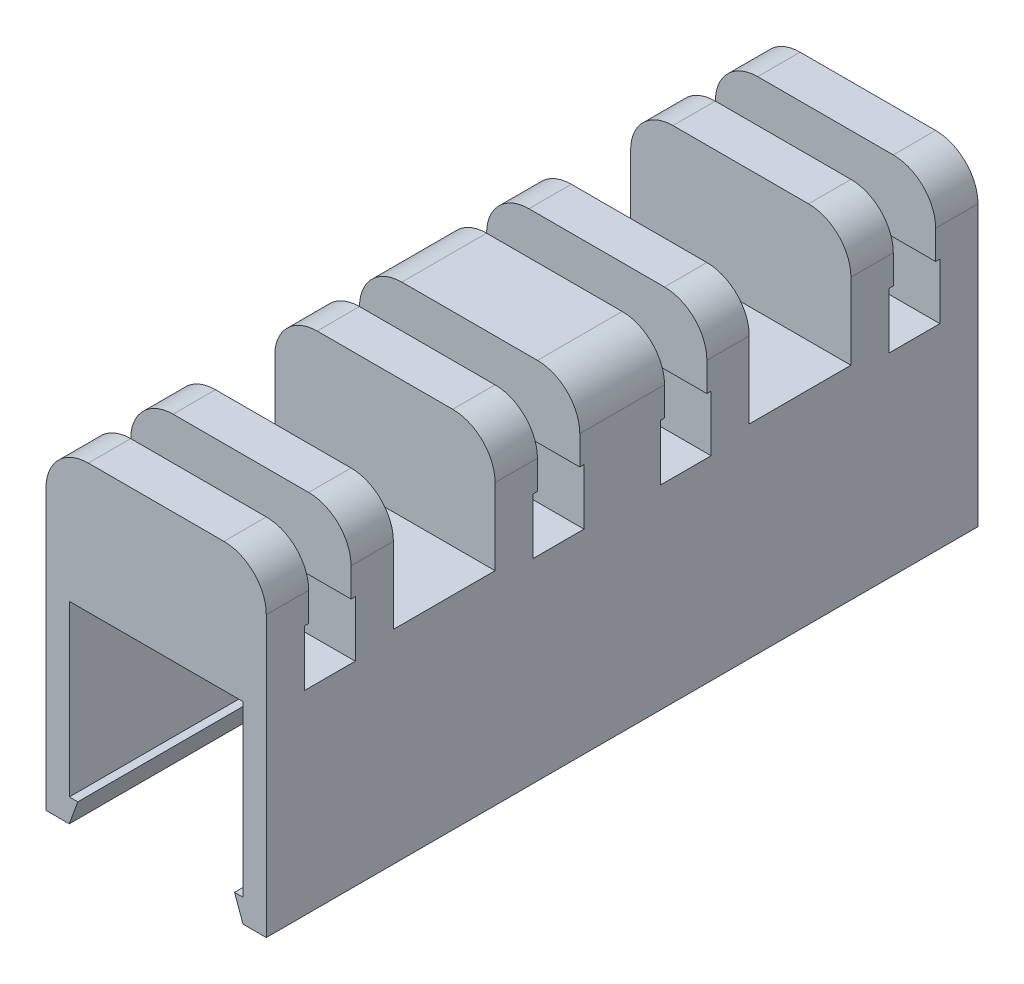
ISO-10303-21;
HEADER;
FILE_DESCRIPTION(('STEP AP214'),'2;1');
FILE_NAME('part.step','',(''),(''),'','','');
FILE_SCHEMA(('AUTOMOTIVE_DESIGN { 1 0 10303 214 1 1 1 1 }'));
ENDSEC;
DATA;
#1=APPLICATION_CONTEXT('core data for automotive mechanical design processes');
#2=APPLICATION_PROTOCOL_DEFINITION('international standard','automotive_design',2000,#1);
#3=PRODUCT_CONTEXT('',#1,'mechanical');
#4=PRODUCT('Part','Part','',(#3));
#5=PRODUCT_RELATED_PRODUCT_CATEGORY('part','',(#4));
#6=PRODUCT_DEFINITION_FORMATION('','',#4);
#7=PRODUCT_DEFINITION_CONTEXT('part definition',#1,'design');
#8=PRODUCT_DEFINITION('design','',#6,#7);
#9=PRODUCT_DEFINITION_SHAPE('','',#8);
#10=(LENGTH_UNIT() NAMED_UNIT(*) SI_UNIT(.MILLI.,.METRE.));
#11=(NAMED_UNIT(*) PLANE_ANGLE_UNIT() SI_UNIT($,.RADIAN.));
#12=(NAMED_UNIT(*) SI_UNIT($,.STERADIAN.) SOLID_ANGLE_UNIT());
#13=UNCERTAINTY_MEASURE_WITH_UNIT(LENGTH_MEASURE(1.E-05),#10,'distance_accuracy_value','');
#14=(GEOMETRIC_REPRESENTATION_CONTEXT(3) GLOBAL_UNCERTAINTY_ASSIGNED_CONTEXT((#13)) GLOBAL_UNIT_ASSIGNED_CONTEXT((#10,
#11,#12)) REPRESENTATION_CONTEXT('',''));
#15=CARTESIAN_POINT('',(0.,0.,0.));
#16=DIRECTION('',(0.,0.,1.));
#17=DIRECTION('',(1.,0.,0.));
#18=AXIS2_PLACEMENT_3D('',#15,#16,#17);
#19=CARTESIAN_POINT('',(8.0000000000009,10.2500000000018,84.));
#20=DIRECTION('',(0.,0.,-1.));
#21=DIRECTION('',(-1.,0.,0.));
#22=AXIS2_PLACEMENT_3D('',#19,#20,#21);
#23=CYLINDRICAL_SURFACE('',#22,4.99999999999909);
#24=DIRECTION('',(0.,0.,-1.));
#25=VECTOR('',#24,1.);
#26=CARTESIAN_POINT('',(13.,10.2500000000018,84.));
#27=LINE('',#26,#25);
#28=CARTESIAN_POINT('',(13.,10.2500000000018,74.));
#29=VERTEX_POINT('',#28);
#30=CARTESIAN_POINT('',(13.,10.2500000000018,69.));
#31=VERTEX_POINT('',#30);
#32=EDGE_CURVE('E687',#29,#31,#27,.T.);
#33=ORIENTED_EDGE('',*,*,#32,.T.);
#34=CARTESIAN_POINT('',(8.0000000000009,10.2500000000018,69.));
#35=DIRECTION('',(0.,0.,1.));
#36=DIRECTION('',(1.,0.,0.));
#37=AXIS2_PLACEMENT_3D('',#34,#35,#36);
#38=CIRCLE('',#37,4.99999999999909);
#39=CARTESIAN_POINT('',(7.99999999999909,15.2500000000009,69.));
#40=VERTEX_POINT('',#39);
#41=EDGE_CURVE('E566',#31,#40,#38,.T.);
#42=ORIENTED_EDGE('',*,*,#41,.T.);
#43=DIRECTION('',(0.,0.,-1.));
#44=VECTOR('',#43,1.);
#45=CARTESIAN_POINT('',(7.99999999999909,15.2500000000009,84.));
#46=LINE('',#45,#44);
#47=CARTESIAN_POINT('',(7.99999999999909,15.2500000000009,74.));
#48=VERTEX_POINT('',#47);
#49=EDGE_CURVE('E681',#48,#40,#46,.T.);
#50=ORIENTED_EDGE('',*,*,#49,.F.);
#51=CARTESIAN_POINT('',(8.0000000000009,10.2500000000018,74.));
#52=DIRECTION('',(0.,0.,-1.));
#53=DIRECTION('',(-1.,0.,0.));
#54=AXIS2_PLACEMENT_3D('',#51,#52,#53);
#55=CIRCLE('',#54,4.99999999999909);
#56=EDGE_CURVE('E559',#48,#29,#55,.T.);
#57=ORIENTED_EDGE('',*,*,#56,.T.);
#58=EDGE_LOOP('',(#33,#42,#50,#57));
#59=FACE_BOUND('',#58,.T.);
#60=ADVANCED_FACE('F36',(#59),#23,.T.);
#61=CARTESIAN_POINT('',(7.99999999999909,15.2500000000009,5.));
#62=VERTEX_POINT('',#61);
#63=CARTESIAN_POINT('',(7.99999999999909,15.2500000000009,0.));
#64=VERTEX_POINT('',#63);
#65=EDGE_CURVE('E674',#62,#64,#46,.T.);
#66=ORIENTED_EDGE('',*,*,#65,.F.);
#67=CARTESIAN_POINT('',(8.0000000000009,10.2500000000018,4.99999999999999));
#68=DIRECTION('',(0.,0.,-1.));
#69=DIRECTION('',(-1.,0.,0.));
#70=AXIS2_PLACEMENT_3D('',#67,#68,#69);
#71=CIRCLE('',#70,4.99999999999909);
#72=CARTESIAN_POINT('',(13.,10.2500000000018,5.));
#73=VERTEX_POINT('',#72);
#74=EDGE_CURVE('E543',#62,#73,#71,.T.);
#75=ORIENTED_EDGE('',*,*,#74,.T.);
#76=CARTESIAN_POINT('',(13.,10.2500000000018,0.));
#77=VERTEX_POINT('',#76);
#78=EDGE_CURVE('E680',#73,#77,#27,.T.);
#79=ORIENTED_EDGE('',*,*,#78,.T.);
#80=CARTESIAN_POINT('',(8.0000000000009,10.2500000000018,0.));
#81=DIRECTION('',(0.,0.,1.));
#82=DIRECTION('',(1.,0.,0.));
#83=AXIS2_PLACEMENT_3D('',#80,#81,#82);
#84=CIRCLE('',#83,4.99999999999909);
#85=EDGE_CURVE('E647',#77,#64,#84,.T.);
#86=ORIENTED_EDGE('',*,*,#85,.T.);
#87=EDGE_LOOP('',(#66,#75,#79,#86));
#88=FACE_BOUND('',#87,.T.);
#89=ADVANCED_FACE('F768',(#88),#23,.T.);
#90=CARTESIAN_POINT('',(13.,10.2500000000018,15.));
#91=VERTEX_POINT('',#90);
#92=CARTESIAN_POINT('',(13.,10.2500000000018,10.));
#93=VERTEX_POINT('',#92);
#94=EDGE_CURVE('E773',#91,#93,#27,.T.);
#95=ORIENTED_EDGE('',*,*,#94,.T.);
#96=CARTESIAN_POINT('',(8.0000000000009,10.2500000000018,9.99999999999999));
#97=DIRECTION('',(0.,0.,1.));
#98=DIRECTION('',(1.,0.,0.));
#99=AXIS2_PLACEMENT_3D('',#96,#97,#98);
#100=CIRCLE('',#99,4.99999999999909);
#101=CARTESIAN_POINT('',(7.99999999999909,15.2500000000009,10.));
#102=VERTEX_POINT('',#101);
#103=EDGE_CURVE('E525',#93,#102,#100,.T.);
#104=ORIENTED_EDGE('',*,*,#103,.T.);
#105=CARTESIAN_POINT('',(7.99999999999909,15.2500000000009,15.));
#106=VERTEX_POINT('',#105);
#107=EDGE_CURVE('E1241',#106,#102,#46,.T.);
#108=ORIENTED_EDGE('',*,*,#107,.F.);
#109=CARTESIAN_POINT('',(8.0000000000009,10.2500000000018,15.));
#110=DIRECTION('',(0.,0.,-1.));
#111=DIRECTION('',(-1.,0.,0.));
#112=AXIS2_PLACEMENT_3D('',#109,#110,#111);
#113=CIRCLE('',#112,4.99999999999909);
#114=EDGE_CURVE('E526',#106,#91,#113,.T.);
#115=ORIENTED_EDGE('',*,*,#114,.T.);
#116=EDGE_LOOP('',(#95,#104,#108,#115));
#117=FACE_BOUND('',#116,.T.);
#118=ADVANCED_FACE('F809',(#117),#23,.T.);
#119=CARTESIAN_POINT('',(13.,10.2500000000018,32.));
#120=VERTEX_POINT('',#119);
#121=CARTESIAN_POINT('',(13.,10.2500000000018,27.));
#122=VERTEX_POINT('',#121);
#123=EDGE_CURVE('E1082',#120,#122,#27,.T.);
#124=ORIENTED_EDGE('',*,*,#123,.T.);
#125=CARTESIAN_POINT('',(8.0000000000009,10.2500000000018,27.));
#126=DIRECTION('',(0.,0.,1.));
#127=DIRECTION('',(1.,0.,0.));
#128=AXIS2_PLACEMENT_3D('',#125,#126,#127);
#129=CIRCLE('',#128,4.99999999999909);
#130=CARTESIAN_POINT('',(7.99999999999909,15.2500000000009,27.));
#131=VERTEX_POINT('',#130);
#132=EDGE_CURVE('E1038',#122,#131,#129,.T.);
#133=ORIENTED_EDGE('',*,*,#132,.T.);
#134=CARTESIAN_POINT('',(7.99999999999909,15.2500000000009,32.));
#135=VERTEX_POINT('',#134);
#136=EDGE_CURVE('E1236',#135,#131,#46,.T.);
#137=ORIENTED_EDGE('',*,*,#136,.F.);
#138=CARTESIAN_POINT('',(8.0000000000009,10.2500000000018,32.));
#139=DIRECTION('',(0.,0.,-1.));
#140=DIRECTION('',(-1.,0.,0.));
#141=AXIS2_PLACEMENT_3D('',#138,#139,#140);
#142=CIRCLE('',#141,4.99999999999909);
#143=EDGE_CURVE('E1030',#135,#120,#142,.T.);
#144=ORIENTED_EDGE('',*,*,#143,.T.);
#145=EDGE_LOOP('',(#124,#133,#137,#144));
#146=FACE_BOUND('',#145,.T.);
#147=ADVANCED_FACE('F834',(#146),#23,.T.);
#148=CARTESIAN_POINT('',(13.,10.2500000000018,47.));
#149=VERTEX_POINT('',#148);
#150=CARTESIAN_POINT('',(13.,10.2500000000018,37.));
#151=VERTEX_POINT('',#150);
#152=EDGE_CURVE('E1077',#149,#151,#27,.T.);
#153=ORIENTED_EDGE('',*,*,#152,.T.);
#154=CARTESIAN_POINT('',(8.0000000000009,10.2500000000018,37.));
#155=DIRECTION('',(0.,0.,1.));
#156=DIRECTION('',(1.,0.,0.));
#157=AXIS2_PLACEMENT_3D('',#154,#155,#156);
#158=CIRCLE('',#157,4.99999999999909);
#159=CARTESIAN_POINT('',(7.99999999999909,15.2500000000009,37.));
#160=VERTEX_POINT('',#159);
#161=EDGE_CURVE('E1023',#151,#160,#158,.T.);
#162=ORIENTED_EDGE('',*,*,#161,.T.);
#163=CARTESIAN_POINT('',(7.99999999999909,15.2500000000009,47.));
#164=VERTEX_POINT('',#163);
#165=EDGE_CURVE('E1240',#164,#160,#46,.T.);
#166=ORIENTED_EDGE('',*,*,#165,.F.);
#167=CARTESIAN_POINT('',(8.0000000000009,10.2500000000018,47.));
#168=DIRECTION('',(0.,0.,-1.));
#169=DIRECTION('',(-1.,0.,0.));
#170=AXIS2_PLACEMENT_3D('',#167,#168,#169);
#171=CIRCLE('',#170,4.99999999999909);
#172=EDGE_CURVE('E1015',#164,#149,#171,.T.);
#173=ORIENTED_EDGE('',*,*,#172,.T.);
#174=EDGE_LOOP('',(#153,#162,#166,#173));
#175=FACE_BOUND('',#174,.T.);
#176=ADVANCED_FACE('F827',(#175),#23,.T.);
#177=CARTESIAN_POINT('',(13.,10.2500000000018,84.));
#178=VERTEX_POINT('',#177);
#179=CARTESIAN_POINT('',(13.,10.2500000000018,79.));
#180=VERTEX_POINT('',#179);
#181=EDGE_CURVE('E682',#178,#180,#27,.T.);
#182=ORIENTED_EDGE('',*,*,#181,.T.);
#183=CARTESIAN_POINT('',(8.0000000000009,10.2500000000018,79.));
#184=DIRECTION('',(0.,0.,1.));
#185=DIRECTION('',(1.,0.,0.));
#186=AXIS2_PLACEMENT_3D('',#183,#184,#185);
#187=CIRCLE('',#186,4.99999999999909);
#188=CARTESIAN_POINT('',(7.99999999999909,15.2500000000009,79.));
#189=VERTEX_POINT('',#188);
#190=EDGE_CURVE('E551',#180,#189,#187,.T.);
#191=ORIENTED_EDGE('',*,*,#190,.T.);
#192=CARTESIAN_POINT('',(7.99999999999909,15.2500000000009,84.));
#193=VERTEX_POINT('',#192);
#194=EDGE_CURVE('E676',#193,#189,#46,.T.);
#195=ORIENTED_EDGE('',*,*,#194,.F.);
#196=CARTESIAN_POINT('',(8.0000000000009,10.2500000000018,84.));
#197=DIRECTION('',(0.,0.,1.));
#198=DIRECTION('',(1.,0.,0.));
#199=AXIS2_PLACEMENT_3D('',#196,#197,#198);
#200=CIRCLE('',#199,4.99999999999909);
#201=EDGE_CURVE('E603',#178,#193,#200,.T.);
#202=ORIENTED_EDGE('',*,*,#201,.F.);
#203=EDGE_LOOP('',(#182,#191,#195,#202));
#204=FACE_BOUND('',#203,.T.);
#205=ADVANCED_FACE('F816',(#204),#23,.T.);
#206=CARTESIAN_POINT('',(-8.00000000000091,15.2500000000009,84.));
#207=DIRECTION('',(0.,-1.,0.));
#208=DIRECTION('',(0.,0.,-1.));
#209=AXIS2_PLACEMENT_3D('',#206,#207,#208);
#210=PLANE('',#209);
#211=ORIENTED_EDGE('',*,*,#49,.T.);
#212=DIRECTION('',(1.,0.,0.));
#213=VECTOR('',#212,1.);
#214=CARTESIAN_POINT('',(-13.,15.2500000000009,69.));
#215=LINE('',#214,#213);
#216=CARTESIAN_POINT('',(-7.9999999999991,15.2500000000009,69.));
#217=VERTEX_POINT('',#216);
#218=EDGE_CURVE('E874',#217,#40,#215,.T.);
#219=ORIENTED_EDGE('',*,*,#218,.F.);
#220=DIRECTION('',(0.,0.,-1.));
#221=VECTOR('',#220,1.);
#222=CARTESIAN_POINT('',(-8.00000000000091,15.2500000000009,84.));
#223=LINE('',#222,#221);
#224=CARTESIAN_POINT('',(-7.9999999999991,15.2500000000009,74.));
#225=VERTEX_POINT('',#224);
#226=EDGE_CURVE('E675',#225,#217,#223,.T.);
#227=ORIENTED_EDGE('',*,*,#226,.F.);
#228=DIRECTION('',(1.,0.,0.));
#229=VECTOR('',#228,1.);
#230=CARTESIAN_POINT('',(-13.,15.2500000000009,74.));
#231=LINE('',#230,#229);
#232=EDGE_CURVE('E878',#225,#48,#231,.T.);
#233=ORIENTED_EDGE('',*,*,#232,.T.);
#234=EDGE_LOOP('',(#211,#219,#227,#233));
#235=FACE_BOUND('',#234,.T.);
#236=ADVANCED_FACE('F823',(#235),#210,.F.);
#237=CARTESIAN_POINT('',(-7.9999999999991,15.2500000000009,4.99999999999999));
#238=VERTEX_POINT('',#237);
#239=CARTESIAN_POINT('',(-8.00000000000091,15.2500000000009,0.));
#240=VERTEX_POINT('',#239);
#241=EDGE_CURVE('E669',#238,#240,#223,.T.);
#242=ORIENTED_EDGE('',*,*,#241,.F.);
#243=DIRECTION('',(1.,0.,0.));
#244=VECTOR('',#243,1.);
#245=CARTESIAN_POINT('',(-13.,15.2500000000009,5.));
#246=LINE('',#245,#244);
#247=EDGE_CURVE('E903',#238,#62,#246,.T.);
#248=ORIENTED_EDGE('',*,*,#247,.T.);
#249=ORIENTED_EDGE('',*,*,#65,.T.);
#250=DIRECTION('',(-1.,0.,0.));
#251=VECTOR('',#250,1.);
#252=CARTESIAN_POINT('',(-8.00000000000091,15.2500000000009,0.));
#253=LINE('',#252,#251);
#254=EDGE_CURVE('E651',#64,#240,#253,.T.);
#255=ORIENTED_EDGE('',*,*,#254,.T.);
#256=EDGE_LOOP('',(#242,#248,#249,#255));
#257=FACE_BOUND('',#256,.T.);
#258=ADVANCED_FACE('F762',(#257),#210,.F.);
#259=ORIENTED_EDGE('',*,*,#107,.T.);
#260=DIRECTION('',(1.,0.,0.));
#261=VECTOR('',#260,1.);
#262=CARTESIAN_POINT('',(-13.,15.2500000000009,10.));
#263=LINE('',#262,#261);
#264=CARTESIAN_POINT('',(-7.9999999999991,15.2500000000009,10.));
#265=VERTEX_POINT('',#264);
#266=EDGE_CURVE('E923',#265,#102,#263,.T.);
#267=ORIENTED_EDGE('',*,*,#266,.F.);
#268=CARTESIAN_POINT('',(-7.9999999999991,15.2500000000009,15.));
#269=VERTEX_POINT('',#268);
#270=EDGE_CURVE('E523',#269,#265,#223,.T.);
#271=ORIENTED_EDGE('',*,*,#270,.F.);
#272=DIRECTION('',(1.,0.,0.));
#273=VECTOR('',#272,1.);
#274=CARTESIAN_POINT('',(-13.,15.2500000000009,15.));
#275=LINE('',#274,#273);
#276=EDGE_CURVE('E926',#269,#106,#275,.T.);
#277=ORIENTED_EDGE('',*,*,#276,.T.);
#278=EDGE_LOOP('',(#259,#267,#271,#277));
#279=FACE_BOUND('',#278,.T.);
#280=ADVANCED_FACE('F1046',(#279),#210,.F.);
#281=ORIENTED_EDGE('',*,*,#136,.T.);
#282=DIRECTION('',(1.,0.,0.));
#283=VECTOR('',#282,1.);
#284=CARTESIAN_POINT('',(-13.,15.2500000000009,27.));
#285=LINE('',#284,#283);
#286=CARTESIAN_POINT('',(-7.9999999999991,15.2500000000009,27.));
#287=VERTEX_POINT('',#286);
#288=EDGE_CURVE('E937',#287,#131,#285,.T.);
#289=ORIENTED_EDGE('',*,*,#288,.F.);
#290=CARTESIAN_POINT('',(-7.9999999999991,15.2500000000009,32.));
#291=VERTEX_POINT('',#290);
#292=EDGE_CURVE('E1049',#291,#287,#223,.T.);
#293=ORIENTED_EDGE('',*,*,#292,.F.);
#294=DIRECTION('',(1.,0.,0.));
#295=VECTOR('',#294,1.);
#296=CARTESIAN_POINT('',(-13.,15.2500000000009,32.));
#297=LINE('',#296,#295);
#298=EDGE_CURVE('E940',#291,#135,#297,.T.);
#299=ORIENTED_EDGE('',*,*,#298,.T.);
#300=EDGE_LOOP('',(#281,#289,#293,#299));
#301=FACE_BOUND('',#300,.T.);
#302=ADVANCED_FACE('F1238',(#301),#210,.F.);
#303=ORIENTED_EDGE('',*,*,#165,.T.);
#304=DIRECTION('',(1.,0.,0.));
#305=VECTOR('',#304,1.);
#306=CARTESIAN_POINT('',(-13.,15.2500000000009,37.));
#307=LINE('',#306,#305);
#308=CARTESIAN_POINT('',(-7.9999999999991,15.2500000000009,37.));
#309=VERTEX_POINT('',#308);
#310=EDGE_CURVE('E962',#309,#160,#307,.T.);
#311=ORIENTED_EDGE('',*,*,#310,.F.);
#312=CARTESIAN_POINT('',(-7.9999999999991,15.2500000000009,47.));
#313=VERTEX_POINT('',#312);
#314=EDGE_CURVE('E1052',#313,#309,#223,.T.);
#315=ORIENTED_EDGE('',*,*,#314,.F.);
#316=DIRECTION('',(1.,0.,0.));
#317=VECTOR('',#316,1.);
#318=CARTESIAN_POINT('',(-13.,15.2500000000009,47.));
#319=LINE('',#318,#317);
#320=EDGE_CURVE('E965',#313,#164,#319,.T.);
#321=ORIENTED_EDGE('',*,*,#320,.T.);
#322=EDGE_LOOP('',(#303,#311,#315,#321));
#323=FACE_BOUND('',#322,.T.);
#324=ADVANCED_FACE('F1755',(#323),#210,.F.);
#325=ORIENTED_EDGE('',*,*,#194,.T.);
#326=DIRECTION('',(1.,0.,0.));
#327=VECTOR('',#326,1.);
#328=CARTESIAN_POINT('',(-13.,15.2500000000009,79.));
#329=LINE('',#328,#327);
#330=CARTESIAN_POINT('',(-7.9999999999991,15.2500000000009,79.));
#331=VERTEX_POINT('',#330);
#332=EDGE_CURVE('E900',#331,#189,#329,.T.);
#333=ORIENTED_EDGE('',*,*,#332,.F.);
#334=CARTESIAN_POINT('',(-8.00000000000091,15.2500000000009,84.));
#335=VERTEX_POINT('',#334);
#336=EDGE_CURVE('E670',#335,#331,#223,.T.);
#337=ORIENTED_EDGE('',*,*,#336,.F.);
#338=DIRECTION('',(-1.,0.,0.));
#339=VECTOR('',#338,1.);
#340=CARTESIAN_POINT('',(-8.00000000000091,15.2500000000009,84.));
#341=LINE('',#340,#339);
#342=EDGE_CURVE('E606',#193,#335,#341,.T.);
#343=ORIENTED_EDGE('',*,*,#342,.F.);
#344=EDGE_LOOP('',(#325,#333,#337,#343));
#345=FACE_BOUND('',#344,.T.);
#346=ADVANCED_FACE('F824',(#345),#210,.F.);
#347=CARTESIAN_POINT('',(-7.9999999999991,10.25,84.));
#348=DIRECTION('',(0.,0.,-1.));
#349=DIRECTION('',(-1.,0.,0.));
#350=AXIS2_PLACEMENT_3D('',#347,#348,#349);
#351=CYLINDRICAL_SURFACE('',#350,5.00000000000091);
#352=ORIENTED_EDGE('',*,*,#226,.T.);
#353=CARTESIAN_POINT('',(-7.9999999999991,10.25,69.));
#354=DIRECTION('',(0.,0.,1.));
#355=DIRECTION('',(1.,0.,0.));
#356=AXIS2_PLACEMENT_3D('',#353,#354,#355);
#357=CIRCLE('',#356,5.00000000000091);
#358=CARTESIAN_POINT('',(-13.,10.25,69.));
#359=VERTEX_POINT('',#358);
#360=EDGE_CURVE('E563',#217,#359,#357,.T.);
#361=ORIENTED_EDGE('',*,*,#360,.T.);
#362=DIRECTION('',(0.,0.,-1.));
#363=VECTOR('',#362,1.);
#364=CARTESIAN_POINT('',(-13.,10.25,84.));
#365=LINE('',#364,#363);
#366=CARTESIAN_POINT('',(-13.,10.25,74.));
#367=VERTEX_POINT('',#366);
#368=EDGE_CURVE('E481',#367,#359,#365,.T.);
#369=ORIENTED_EDGE('',*,*,#368,.F.);
#370=CARTESIAN_POINT('',(-7.9999999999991,10.25,74.));
#371=DIRECTION('',(0.,0.,-1.));
#372=DIRECTION('',(-1.,0.,0.));
#373=AXIS2_PLACEMENT_3D('',#370,#371,#372);
#374=CIRCLE('',#373,5.00000000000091);
#375=EDGE_CURVE('E555',#367,#225,#374,.T.);
#376=ORIENTED_EDGE('',*,*,#375,.T.);
#377=EDGE_LOOP('',(#352,#361,#369,#376));
#378=FACE_BOUND('',#377,.T.);
#379=ADVANCED_FACE('F1070',(#378),#351,.T.);
#380=CARTESIAN_POINT('',(-13.,10.25,5.));
#381=VERTEX_POINT('',#380);
#382=CARTESIAN_POINT('',(-13.,10.25,0.));
#383=VERTEX_POINT('',#382);
#384=EDGE_CURVE('E664',#381,#383,#365,.T.);
#385=ORIENTED_EDGE('',*,*,#384,.F.);
#386=CARTESIAN_POINT('',(-7.9999999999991,10.25,4.99999999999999));
#387=DIRECTION('',(0.,0.,-1.));
#388=DIRECTION('',(-1.,0.,0.));
#389=AXIS2_PLACEMENT_3D('',#386,#387,#388);
#390=CIRCLE('',#389,5.00000000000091);
#391=EDGE_CURVE('E532',#381,#238,#390,.T.);
#392=ORIENTED_EDGE('',*,*,#391,.T.);
#393=ORIENTED_EDGE('',*,*,#241,.T.);
#394=CARTESIAN_POINT('',(-7.9999999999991,10.25,0.));
#395=DIRECTION('',(0.,0.,1.));
#396=DIRECTION('',(1.,0.,0.));
#397=AXIS2_PLACEMENT_3D('',#394,#395,#396);
#398=CIRCLE('',#397,5.00000000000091);
#399=EDGE_CURVE('E655',#240,#383,#398,.T.);
#400=ORIENTED_EDGE('',*,*,#399,.T.);
#401=EDGE_LOOP('',(#385,#392,#393,#400));
#402=FACE_BOUND('',#401,.T.);
#403=ADVANCED_FACE('F757',(#402),#351,.T.);
#404=ORIENTED_EDGE('',*,*,#270,.T.);
#405=CARTESIAN_POINT('',(-7.9999999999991,10.25,9.99999999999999));
#406=DIRECTION('',(0.,0.,1.));
#407=DIRECTION('',(1.,0.,0.));
#408=AXIS2_PLACEMENT_3D('',#405,#406,#407);
#409=CIRCLE('',#408,5.00000000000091);
#410=CARTESIAN_POINT('',(-13.,10.25,10.));
#411=VERTEX_POINT('',#410);
#412=EDGE_CURVE('E515',#265,#411,#409,.T.);
#413=ORIENTED_EDGE('',*,*,#412,.T.);
#414=CARTESIAN_POINT('',(-13.,10.25,15.));
#415=VERTEX_POINT('',#414);
#416=EDGE_CURVE('E511',#415,#411,#365,.T.);
#417=ORIENTED_EDGE('',*,*,#416,.F.);
#418=CARTESIAN_POINT('',(-7.9999999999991,10.25,15.));
#419=DIRECTION('',(0.,0.,-1.));
#420=DIRECTION('',(-1.,0.,0.));
#421=AXIS2_PLACEMENT_3D('',#418,#419,#420);
#422=CIRCLE('',#421,5.00000000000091);
#423=EDGE_CURVE('E536',#415,#269,#422,.T.);
#424=ORIENTED_EDGE('',*,*,#423,.T.);
#425=EDGE_LOOP('',(#404,#413,#417,#424));
#426=FACE_BOUND('',#425,.T.);
#427=ADVANCED_FACE('F520',(#426),#351,.T.);
#428=ORIENTED_EDGE('',*,*,#292,.T.);
#429=CARTESIAN_POINT('',(-7.9999999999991,10.25,27.));
#430=DIRECTION('',(0.,0.,1.));
#431=DIRECTION('',(1.,0.,0.));
#432=AXIS2_PLACEMENT_3D('',#429,#430,#431);
#433=CIRCLE('',#432,5.00000000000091);
#434=CARTESIAN_POINT('',(-13.,10.25,27.));
#435=VERTEX_POINT('',#434);
#436=EDGE_CURVE('E1034',#287,#435,#433,.T.);
#437=ORIENTED_EDGE('',*,*,#436,.T.);
#438=CARTESIAN_POINT('',(-13.,10.25,32.));
#439=VERTEX_POINT('',#438);
#440=EDGE_CURVE('E1266',#439,#435,#365,.T.);
#441=ORIENTED_EDGE('',*,*,#440,.F.);
#442=CARTESIAN_POINT('',(-7.9999999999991,10.25,32.));
#443=DIRECTION('',(0.,0.,-1.));
#444=DIRECTION('',(-1.,0.,0.));
#445=AXIS2_PLACEMENT_3D('',#442,#443,#444);
#446=CIRCLE('',#445,5.00000000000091);
#447=EDGE_CURVE('E1027',#439,#291,#446,.T.);
#448=ORIENTED_EDGE('',*,*,#447,.T.);
#449=EDGE_LOOP('',(#428,#437,#441,#448));
#450=FACE_BOUND('',#449,.T.);
#451=ADVANCED_FACE('F1428',(#450),#351,.T.);
#452=ORIENTED_EDGE('',*,*,#314,.T.);
#453=CARTESIAN_POINT('',(-7.9999999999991,10.25,37.));
#454=DIRECTION('',(0.,0.,1.));
#455=DIRECTION('',(1.,0.,0.));
#456=AXIS2_PLACEMENT_3D('',#453,#454,#455);
#457=CIRCLE('',#456,5.00000000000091);
#458=CARTESIAN_POINT('',(-13.,10.25,37.));
#459=VERTEX_POINT('',#458);
#460=EDGE_CURVE('E1019',#309,#459,#457,.T.);
#461=ORIENTED_EDGE('',*,*,#460,.T.);
#462=CARTESIAN_POINT('',(-13.,10.25,47.));
#463=VERTEX_POINT('',#462);
#464=EDGE_CURVE('E1260',#463,#459,#365,.T.);
#465=ORIENTED_EDGE('',*,*,#464,.F.);
#466=CARTESIAN_POINT('',(-7.9999999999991,10.25,47.));
#467=DIRECTION('',(0.,0.,-1.));
#468=DIRECTION('',(-1.,0.,0.));
#469=AXIS2_PLACEMENT_3D('',#466,#467,#468);
#470=CIRCLE('',#469,5.00000000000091);
#471=EDGE_CURVE('E1011',#463,#313,#470,.T.);
#472=ORIENTED_EDGE('',*,*,#471,.T.);
#473=EDGE_LOOP('',(#452,#461,#465,#472));
#474=FACE_BOUND('',#473,.T.);
#475=ADVANCED_FACE('F1422',(#474),#351,.T.);
#476=ORIENTED_EDGE('',*,*,#336,.T.);
#477=CARTESIAN_POINT('',(-7.9999999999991,10.25,79.));
#478=DIRECTION('',(0.,0.,1.));
#479=DIRECTION('',(1.,0.,0.));
#480=AXIS2_PLACEMENT_3D('',#477,#478,#479);
#481=CIRCLE('',#480,5.00000000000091);
#482=CARTESIAN_POINT('',(-13.,10.25,79.));
#483=VERTEX_POINT('',#482);
#484=EDGE_CURVE('E547',#331,#483,#481,.T.);
#485=ORIENTED_EDGE('',*,*,#484,.T.);
#486=CARTESIAN_POINT('',(-13.,10.25,84.));
#487=VERTEX_POINT('',#486);
#488=EDGE_CURVE('E665',#487,#483,#365,.T.);
#489=ORIENTED_EDGE('',*,*,#488,.F.);
#490=CARTESIAN_POINT('',(-7.9999999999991,10.25,84.));
#491=DIRECTION('',(0.,0.,1.));
#492=DIRECTION('',(1.,0.,0.));
#493=AXIS2_PLACEMENT_3D('',#490,#491,#492);
#494=CIRCLE('',#493,5.00000000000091);
#495=EDGE_CURVE('E609',#335,#487,#494,.T.);
#496=ORIENTED_EDGE('',*,*,#495,.F.);
#497=EDGE_LOOP('',(#476,#485,#489,#496));
#498=FACE_BOUND('',#497,.T.);
#499=ADVANCED_FACE('F1417',(#498),#351,.T.);
#500=CARTESIAN_POINT('',(-10.25,-22.75,84.));
#501=DIRECTION('',(0.,1.,0.));
#502=DIRECTION('',(0.,0.,1.));
#503=AXIS2_PLACEMENT_3D('',#500,#501,#502);
#504=PLANE('',#503);
#505=DIRECTION('',(1.,0.,0.));
#506=VECTOR('',#505,1.);
#507=CARTESIAN_POINT('',(-10.25,-22.75,0.));
#508=LINE('',#507,#506);
#509=CARTESIAN_POINT('',(-13.,-22.75,0.));
#510=VERTEX_POINT('',#509);
#511=CARTESIAN_POINT('',(-10.25,-22.75,0.));
#512=VERTEX_POINT('',#511);
#513=EDGE_CURVE('E570',#510,#512,#508,.T.);
#514=ORIENTED_EDGE('',*,*,#513,.T.);
#515=DIRECTION('',(0.,0.,-1.));
#516=VECTOR('',#515,1.);
#517=CARTESIAN_POINT('',(-10.25,-22.75,84.));
#518=LINE('',#517,#516);
#519=CARTESIAN_POINT('',(-10.25,-22.75,84.));
#520=VERTEX_POINT('',#519);
#521=EDGE_CURVE('E484',#520,#512,#518,.T.);
#522=ORIENTED_EDGE('',*,*,#521,.F.);
#523=DIRECTION('',(1.,0.,0.));
#524=VECTOR('',#523,1.);
#525=CARTESIAN_POINT('',(-10.25,-22.75,84.));
#526=LINE('',#525,#524);
#527=CARTESIAN_POINT('',(-13.,-22.75,84.));
#528=VERTEX_POINT('',#527);
#529=EDGE_CURVE('E571',#528,#520,#526,.T.);
#530=ORIENTED_EDGE('',*,*,#529,.F.);
#531=DIRECTION('',(0.,0.,-1.));
#532=VECTOR('',#531,1.);
#533=CARTESIAN_POINT('',(-13.,-22.75,84.));
#534=LINE('',#533,#532);
#535=EDGE_CURVE('E615',#528,#510,#534,.T.);
#536=ORIENTED_EDGE('',*,*,#535,.T.);
#537=EDGE_LOOP('',(#514,#522,#530,#536));
#538=FACE_BOUND('',#537,.T.);
#539=ADVANCED_FACE('F38',(#538),#504,.F.);
#540=CARTESIAN_POINT('',(-9.25,-20.,84.));
#541=DIRECTION('',(-0.939793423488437,0.341743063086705,0.));
#542=DIRECTION('',(-0.341743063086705,-0.939793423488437,0.));
#543=AXIS2_PLACEMENT_3D('',#540,#541,#542);
#544=PLANE('',#543);
#545=DIRECTION('',(0.341743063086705,0.939793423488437,0.));
#546=VECTOR('',#545,1.);
#547=CARTESIAN_POINT('',(-9.25,-20.,0.));
#548=LINE('',#547,#546);
#549=CARTESIAN_POINT('',(-9.25,-20.,0.));
#550=VERTEX_POINT('',#549);
#551=EDGE_CURVE('E619',#512,#550,#548,.T.);
#552=ORIENTED_EDGE('',*,*,#551,.T.);
#553=DIRECTION('',(0.,0.,-1.));
#554=VECTOR('',#553,1.);
#555=CARTESIAN_POINT('',(-9.25,-20.,84.));
#556=LINE('',#555,#554);
#557=CARTESIAN_POINT('',(-9.25,-20.,84.));
#558=VERTEX_POINT('',#557);
#559=EDGE_CURVE('E494',#558,#550,#556,.T.);
#560=ORIENTED_EDGE('',*,*,#559,.F.);
#561=DIRECTION('',(0.341743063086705,0.939793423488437,0.));
#562=VECTOR('',#561,1.);
#563=CARTESIAN_POINT('',(-9.25,-20.,84.));
#564=LINE('',#563,#562);
#565=EDGE_CURVE('E575',#520,#558,#564,.T.);
#566=ORIENTED_EDGE('',*,*,#565,.F.);
#567=ORIENTED_EDGE('',*,*,#521,.T.);
#568=EDGE_LOOP('',(#552,#560,#566,#567));
#569=FACE_BOUND('',#568,.T.);
#570=ADVANCED_FACE('F743',(#569),#544,.F.);
#571=CARTESIAN_POINT('',(-9.25,-20.,84.));
#572=DIRECTION('',(0.,-1.,0.));
#573=DIRECTION('',(0.,0.,-1.));
#574=AXIS2_PLACEMENT_3D('',#571,#572,#573);
#575=PLANE('',#574);
#576=DIRECTION('',(-1.,0.,0.));
#577=VECTOR('',#576,1.);
#578=CARTESIAN_POINT('',(-9.25,-20.,0.));
#579=LINE('',#578,#577);
#580=CARTESIAN_POINT('',(-10.25,-20.,0.));
#581=VERTEX_POINT('',#580);
#582=EDGE_CURVE('E622',#550,#581,#579,.T.);
#583=ORIENTED_EDGE('',*,*,#582,.T.);
#584=DIRECTION('',(0.,0.,-1.));
#585=VECTOR('',#584,1.);
#586=CARTESIAN_POINT('',(-10.25,-20.,84.));
#587=LINE('',#586,#585);
#588=CARTESIAN_POINT('',(-10.25,-20.,84.));
#589=VERTEX_POINT('',#588);
#590=EDGE_CURVE('E710',#589,#581,#587,.T.);
#591=ORIENTED_EDGE('',*,*,#590,.F.);
#592=DIRECTION('',(-1.,0.,0.));
#593=VECTOR('',#592,1.);
#594=CARTESIAN_POINT('',(-9.25,-20.,84.));
#595=LINE('',#594,#593);
#596=EDGE_CURVE('E579',#558,#589,#595,.T.);
#597=ORIENTED_EDGE('',*,*,#596,.F.);
#598=ORIENTED_EDGE('',*,*,#559,.T.);
#599=EDGE_LOOP('',(#583,#591,#597,#598));
#600=FACE_BOUND('',#599,.T.);
#601=ADVANCED_FACE('F720',(#600),#575,.F.);
#602=CARTESIAN_POINT('',(-10.25,-20.,84.));
#603=DIRECTION('',(-1.,0.,0.));
#604=DIRECTION('',(0.,0.,1.));
#605=AXIS2_PLACEMENT_3D('',#602,#603,#604);
#606=PLANE('',#605);
#607=DIRECTION('',(0.,1.,0.));
#608=VECTOR('',#607,1.);
#609=CARTESIAN_POINT('',(-10.25,-20.,0.));
#610=LINE('',#609,#608);
#611=CARTESIAN_POINT('',(-10.25,0.,0.));
#612=VERTEX_POINT('',#611);
#613=EDGE_CURVE('E625',#581,#612,#610,.T.);
#614=ORIENTED_EDGE('',*,*,#613,.T.);
#615=DIRECTION('',(0.,0.,-1.));
#616=VECTOR('',#615,1.);
#617=CARTESIAN_POINT('',(-10.25,0.,84.));
#618=LINE('',#617,#616);
#619=CARTESIAN_POINT('',(-10.25,0.,84.));
#620=VERTEX_POINT('',#619);
#621=EDGE_CURVE('E706',#620,#612,#618,.T.);
#622=ORIENTED_EDGE('',*,*,#621,.F.);
#623=DIRECTION('',(0.,1.,0.));
#624=VECTOR('',#623,1.);
#625=CARTESIAN_POINT('',(-10.25,-20.,84.));
#626=LINE('',#625,#624);
#627=EDGE_CURVE('E582',#589,#620,#626,.T.);
#628=ORIENTED_EDGE('',*,*,#627,.F.);
#629=ORIENTED_EDGE('',*,*,#590,.T.);
#630=EDGE_LOOP('',(#614,#622,#628,#629));
#631=FACE_BOUND('',#630,.T.);
#632=ADVANCED_FACE('F731',(#631),#606,.F.);
#633=CARTESIAN_POINT('',(10.25,0.,84.));
#634=DIRECTION('',(0.,1.,0.));
#635=DIRECTION('',(0.,0.,1.));
#636=AXIS2_PLACEMENT_3D('',#633,#634,#635);
#637=PLANE('',#636);
#638=DIRECTION('',(1.,0.,0.));
#639=VECTOR('',#638,1.);
#640=CARTESIAN_POINT('',(10.25,0.,0.));
#641=LINE('',#640,#639);
#642=CARTESIAN_POINT('',(10.25,0.,0.));
#643=VERTEX_POINT('',#642);
#644=EDGE_CURVE('E628',#612,#643,#641,.T.);
#645=ORIENTED_EDGE('',*,*,#644,.T.);
#646=DIRECTION('',(0.,0.,-1.));
#647=VECTOR('',#646,1.);
#648=CARTESIAN_POINT('',(10.25,0.,84.));
#649=LINE('',#648,#647);
#650=CARTESIAN_POINT('',(10.25,0.,84.));
#651=VERTEX_POINT('',#650);
#652=EDGE_CURVE('E703',#651,#643,#649,.T.);
#653=ORIENTED_EDGE('',*,*,#652,.F.);
#654=DIRECTION('',(1.,0.,0.));
#655=VECTOR('',#654,1.);
#656=CARTESIAN_POINT('',(10.25,0.,84.));
#657=LINE('',#656,#655);
#658=EDGE_CURVE('E585',#620,#651,#657,.T.);
#659=ORIENTED_EDGE('',*,*,#658,.F.);
#660=ORIENTED_EDGE('',*,*,#621,.T.);
#661=EDGE_LOOP('',(#645,#653,#659,#660));
#662=FACE_BOUND('',#661,.T.);
#663=ADVANCED_FACE('F735',(#662),#637,.F.);
#664=CARTESIAN_POINT('',(10.25,-20.,84.));
#665=DIRECTION('',(1.,0.,0.));
#666=DIRECTION('',(0.,0.,-1.));
#667=AXIS2_PLACEMENT_3D('',#664,#665,#666);
#668=PLANE('',#667);
#669=DIRECTION('',(0.,-1.,0.));
#670=VECTOR('',#669,1.);
#671=CARTESIAN_POINT('',(10.25,-20.,0.));
#672=LINE('',#671,#670);
#673=CARTESIAN_POINT('',(10.25,-20.,0.));
#674=VERTEX_POINT('',#673);
#675=EDGE_CURVE('E631',#643,#674,#672,.T.);
#676=ORIENTED_EDGE('',*,*,#675,.T.);
#677=DIRECTION('',(0.,0.,-1.));
#678=VECTOR('',#677,1.);
#679=CARTESIAN_POINT('',(10.25,-20.,84.));
#680=LINE('',#679,#678);
#681=CARTESIAN_POINT('',(10.25,-20.,84.));
#682=VERTEX_POINT('',#681);
#683=EDGE_CURVE('E699',#682,#674,#680,.T.);
#684=ORIENTED_EDGE('',*,*,#683,.F.);
#685=DIRECTION('',(0.,-1.,0.));
#686=VECTOR('',#685,1.);
#687=CARTESIAN_POINT('',(10.25,-20.,84.));
#688=LINE('',#687,#686);
#689=EDGE_CURVE('E588',#651,#682,#688,.T.);
#690=ORIENTED_EDGE('',*,*,#689,.F.);
#691=ORIENTED_EDGE('',*,*,#652,.T.);
#692=EDGE_LOOP('',(#676,#684,#690,#691));
#693=FACE_BOUND('',#692,.T.);
#694=ADVANCED_FACE('F793',(#693),#668,.F.);
#695=CARTESIAN_POINT('',(10.25,-20.,84.));
#696=DIRECTION('',(0.,-1.,0.));
#697=DIRECTION('',(0.,0.,-1.));
#698=AXIS2_PLACEMENT_3D('',#695,#696,#697);
#699=PLANE('',#698);
#700=DIRECTION('',(-1.,0.,0.));
#701=VECTOR('',#700,1.);
#702=CARTESIAN_POINT('',(10.25,-20.,0.));
#703=LINE('',#702,#701);
#704=CARTESIAN_POINT('',(9.25,-20.,0.));
#705=VERTEX_POINT('',#704);
#706=EDGE_CURVE('E634',#674,#705,#703,.T.);
#707=ORIENTED_EDGE('',*,*,#706,.T.);
#708=DIRECTION('',(0.,0.,-1.));
#709=VECTOR('',#708,1.);
#710=CARTESIAN_POINT('',(9.25,-20.,84.));
#711=LINE('',#710,#709);
#712=CARTESIAN_POINT('',(9.25,-20.,84.));
#713=VERTEX_POINT('',#712);
#714=EDGE_CURVE('E695',#713,#705,#711,.T.);
#715=ORIENTED_EDGE('',*,*,#714,.F.);
#716=DIRECTION('',(-1.,0.,0.));
#717=VECTOR('',#716,1.);
#718=CARTESIAN_POINT('',(10.25,-20.,84.));
#719=LINE('',#718,#717);
#720=EDGE_CURVE('E591',#682,#713,#719,.T.);
#721=ORIENTED_EDGE('',*,*,#720,.F.);
#722=ORIENTED_EDGE('',*,*,#683,.T.);
#723=EDGE_LOOP('',(#707,#715,#721,#722));
#724=FACE_BOUND('',#723,.T.);
#725=ADVANCED_FACE('F791',(#724),#699,.F.);
#726=CARTESIAN_POINT('',(9.25,-20.,84.));
#727=DIRECTION('',(0.939793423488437,0.341743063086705,0.));
#728=DIRECTION('',(-0.341743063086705,0.939793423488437,0.));
#729=AXIS2_PLACEMENT_3D('',#726,#727,#728);
#730=PLANE('',#729);
#731=DIRECTION('',(0.341743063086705,-0.939793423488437,0.));
#732=VECTOR('',#731,1.);
#733=CARTESIAN_POINT('',(9.25,-20.,0.));
#734=LINE('',#733,#732);
#735=CARTESIAN_POINT('',(10.25,-22.75,0.));
#736=VERTEX_POINT('',#735);
#737=EDGE_CURVE('E637',#705,#736,#734,.T.);
#738=ORIENTED_EDGE('',*,*,#737,.T.);
#739=DIRECTION('',(0.,0.,-1.));
#740=VECTOR('',#739,1.);
#741=CARTESIAN_POINT('',(10.25,-22.75,84.));
#742=LINE('',#741,#740);
#743=CARTESIAN_POINT('',(10.25,-22.75,84.));
#744=VERTEX_POINT('',#743);
#745=EDGE_CURVE('E691',#744,#736,#742,.T.);
#746=ORIENTED_EDGE('',*,*,#745,.F.);
#747=DIRECTION('',(0.341743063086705,-0.939793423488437,0.));
#748=VECTOR('',#747,1.);
#749=CARTESIAN_POINT('',(9.25,-20.,84.));
#750=LINE('',#749,#748);
#751=EDGE_CURVE('E594',#713,#744,#750,.T.);
#752=ORIENTED_EDGE('',*,*,#751,.F.);
#753=ORIENTED_EDGE('',*,*,#714,.T.);
#754=EDGE_LOOP('',(#738,#746,#752,#753));
#755=FACE_BOUND('',#754,.T.);
#756=ADVANCED_FACE('F786',(#755),#730,.F.);
#757=CARTESIAN_POINT('',(13.,-22.75,84.));
#758=DIRECTION('',(0.,1.,0.));
#759=DIRECTION('',(0.,0.,1.));
#760=AXIS2_PLACEMENT_3D('',#757,#758,#759);
#761=PLANE('',#760);
#762=DIRECTION('',(1.,0.,0.));
#763=VECTOR('',#762,1.);
#764=CARTESIAN_POINT('',(13.,-22.75,0.));
#765=LINE('',#764,#763);
#766=CARTESIAN_POINT('',(13.,-22.75,0.));
#767=VERTEX_POINT('',#766);
#768=EDGE_CURVE('E640',#736,#767,#765,.T.);
#769=ORIENTED_EDGE('',*,*,#768,.T.);
#770=DIRECTION('',(0.,0.,-1.));
#771=VECTOR('',#770,1.);
#772=CARTESIAN_POINT('',(13.,-22.75,84.));
#773=LINE('',#772,#771);
#774=CARTESIAN_POINT('',(13.,-22.75,84.));
#775=VERTEX_POINT('',#774);
#776=EDGE_CURVE('E686',#775,#767,#773,.T.);
#777=ORIENTED_EDGE('',*,*,#776,.F.);
#778=DIRECTION('',(1.,0.,0.));
#779=VECTOR('',#778,1.);
#780=CARTESIAN_POINT('',(13.,-22.75,84.));
#781=LINE('',#780,#779);
#782=EDGE_CURVE('E597',#744,#775,#781,.T.);
#783=ORIENTED_EDGE('',*,*,#782,.F.);
#784=ORIENTED_EDGE('',*,*,#745,.T.);
#785=EDGE_LOOP('',(#769,#777,#783,#784));
#786=FACE_BOUND('',#785,.T.);
#787=ADVANCED_FACE('F781',(#786),#761,.F.);
#788=CARTESIAN_POINT('',(13.,-22.75,84.));
#789=DIRECTION('',(-1.,0.,0.));
#790=DIRECTION('',(0.,-1.,0.));
#791=AXIS2_PLACEMENT_3D('',#788,#789,#790);
#792=PLANE('',#791);
#793=ORIENTED_EDGE('',*,*,#32,.F.);
#794=DIRECTION('',(0.,1.,0.));
#795=VECTOR('',#794,1.);
#796=CARTESIAN_POINT('',(13.,15.2500000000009,74.));
#797=LINE('',#796,#795);
#798=CARTESIAN_POINT('',(13.,6.85340306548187,74.));
#799=VERTEX_POINT('',#798);
#800=EDGE_CURVE('E474',#799,#29,#797,.T.);
#801=ORIENTED_EDGE('',*,*,#800,.F.);
#802=DIRECTION('',(0.,0.,1.));
#803=VECTOR('',#802,1.);
#804=CARTESIAN_POINT('',(13.,6.85340306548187,74.));
#805=LINE('',#804,#803);
#806=CARTESIAN_POINT('',(13.,6.85340306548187,73.5));
#807=VERTEX_POINT('',#806);
#808=EDGE_CURVE('E868',#807,#799,#805,.T.);
#809=ORIENTED_EDGE('',*,*,#808,.F.);
#810=DIRECTION('',(0.,1.,0.));
#811=VECTOR('',#810,1.);
#812=CARTESIAN_POINT('',(13.,6.85340306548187,73.5));
#813=LINE('',#812,#811);
#814=CARTESIAN_POINT('',(13.,0.250000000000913,73.5));
#815=VERTEX_POINT('',#814);
#816=EDGE_CURVE('E864',#815,#807,#813,.T.);
#817=ORIENTED_EDGE('',*,*,#816,.F.);
#818=DIRECTION('',(0.,0.,-1.));
#819=VECTOR('',#818,1.);
#820=CARTESIAN_POINT('',(13.,0.250000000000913,79.5));
#821=LINE('',#820,#819);
#822=CARTESIAN_POINT('',(13.,0.250000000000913,79.5));
#823=VERTEX_POINT('',#822);
#824=EDGE_CURVE('E860',#823,#815,#821,.T.);
#825=ORIENTED_EDGE('',*,*,#824,.F.);
#826=DIRECTION('',(0.,-1.,0.));
#827=VECTOR('',#826,1.);
#828=CARTESIAN_POINT('',(13.,6.85340306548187,79.5));
#829=LINE('',#828,#827);
#830=CARTESIAN_POINT('',(13.,6.85340306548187,79.5));
#831=VERTEX_POINT('',#830);
#832=EDGE_CURVE('E850',#831,#823,#829,.T.);
#833=ORIENTED_EDGE('',*,*,#832,.F.);
#834=DIRECTION('',(0.,0.,1.));
#835=VECTOR('',#834,1.);
#836=CARTESIAN_POINT('',(13.,6.85340306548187,79.5));
#837=LINE('',#836,#835);
#838=CARTESIAN_POINT('',(13.,6.85340306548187,79.));
#839=VERTEX_POINT('',#838);
#840=EDGE_CURVE('E843',#839,#831,#837,.T.);
#841=ORIENTED_EDGE('',*,*,#840,.F.);
#842=DIRECTION('',(0.,-1.,0.));
#843=VECTOR('',#842,1.);
#844=CARTESIAN_POINT('',(13.,15.2500000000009,79.));
#845=LINE('',#844,#843);
#846=EDGE_CURVE('E840',#180,#839,#845,.T.);
#847=ORIENTED_EDGE('',*,*,#846,.F.);
#848=ORIENTED_EDGE('',*,*,#181,.F.);
#849=DIRECTION('',(0.,1.,0.));
#850=VECTOR('',#849,1.);
#851=CARTESIAN_POINT('',(13.,-22.75,84.));
#852=LINE('',#851,#850);
#853=EDGE_CURVE('E600',#775,#178,#852,.T.);
#854=ORIENTED_EDGE('',*,*,#853,.F.);
#855=ORIENTED_EDGE('',*,*,#776,.T.);
#856=DIRECTION('',(0.,1.,0.));
#857=VECTOR('',#856,1.);
#858=CARTESIAN_POINT('',(13.,-22.75,0.));
#859=LINE('',#858,#857);
#860=EDGE_CURVE('E643',#767,#77,#859,.T.);
#861=ORIENTED_EDGE('',*,*,#860,.T.);
#862=ORIENTED_EDGE('',*,*,#78,.F.);
#863=DIRECTION('',(0.,1.,0.));
#864=VECTOR('',#863,1.);
#865=CARTESIAN_POINT('',(13.,15.2500000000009,5.));
#866=LINE('',#865,#864);
#867=CARTESIAN_POINT('',(13.,6.85340306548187,5.));
#868=VERTEX_POINT('',#867);
#869=EDGE_CURVE('E846',#868,#73,#866,.T.);
#870=ORIENTED_EDGE('',*,*,#869,.F.);
#871=DIRECTION('',(0.,0.,1.));
#872=VECTOR('',#871,1.);
#873=CARTESIAN_POINT('',(13.,6.85340306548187,5.));
#874=LINE('',#873,#872);
#875=CARTESIAN_POINT('',(13.,6.85340306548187,4.5));
#876=VERTEX_POINT('',#875);
#877=EDGE_CURVE('E853',#876,#868,#874,.T.);
#878=ORIENTED_EDGE('',*,*,#877,.F.);
#879=DIRECTION('',(0.,1.,0.));
#880=VECTOR('',#879,1.);
#881=CARTESIAN_POINT('',(13.,6.85340306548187,4.5));
#882=LINE('',#881,#880);
#883=CARTESIAN_POINT('',(13.,0.250000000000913,4.5));
#884=VERTEX_POINT('',#883);
#885=EDGE_CURVE('E1120',#884,#876,#882,.T.);
#886=ORIENTED_EDGE('',*,*,#885,.F.);
#887=DIRECTION('',(0.,0.,-1.));
#888=VECTOR('',#887,1.);
#889=CARTESIAN_POINT('',(13.,0.250000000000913,10.5));
#890=LINE('',#889,#888);
#891=CARTESIAN_POINT('',(13.,0.250000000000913,10.5));
#892=VERTEX_POINT('',#891);
#893=EDGE_CURVE('E1116',#892,#884,#890,.T.);
#894=ORIENTED_EDGE('',*,*,#893,.F.);
#895=DIRECTION('',(0.,-1.,0.));
#896=VECTOR('',#895,1.);
#897=CARTESIAN_POINT('',(13.,6.85340306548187,10.5));
#898=LINE('',#897,#896);
#899=CARTESIAN_POINT('',(13.,6.85340306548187,10.5));
#900=VERTEX_POINT('',#899);
#901=EDGE_CURVE('E1106',#900,#892,#898,.T.);
#902=ORIENTED_EDGE('',*,*,#901,.F.);
#903=DIRECTION('',(0.,0.,1.));
#904=VECTOR('',#903,1.);
#905=CARTESIAN_POINT('',(13.,6.85340306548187,10.5));
#906=LINE('',#905,#904);
#907=CARTESIAN_POINT('',(13.,6.85340306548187,10.));
#908=VERTEX_POINT('',#907);
#909=EDGE_CURVE('E1101',#908,#900,#906,.T.);
#910=ORIENTED_EDGE('',*,*,#909,.F.);
#911=DIRECTION('',(0.,-1.,0.));
#912=VECTOR('',#911,1.);
#913=CARTESIAN_POINT('',(13.,15.2500000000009,10.));
#914=LINE('',#913,#912);
#915=EDGE_CURVE('E1098',#93,#908,#914,.T.);
#916=ORIENTED_EDGE('',*,*,#915,.F.);
#917=ORIENTED_EDGE('',*,*,#94,.F.);
#918=DIRECTION('',(0.,1.,0.));
#919=VECTOR('',#918,1.);
#920=CARTESIAN_POINT('',(13.,15.2500000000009,15.));
#921=LINE('',#920,#919);
#922=CARTESIAN_POINT('',(13.,1.25000000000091,15.));
#923=VERTEX_POINT('',#922);
#924=EDGE_CURVE('E1096',#923,#91,#921,.T.);
#925=ORIENTED_EDGE('',*,*,#924,.F.);
#926=DIRECTION('',(0.,0.,-1.));
#927=VECTOR('',#926,1.);
#928=CARTESIAN_POINT('',(13.,1.25000000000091,27.));
#929=LINE('',#928,#927);
#930=CARTESIAN_POINT('',(13.,1.25000000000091,27.));
#931=VERTEX_POINT('',#930);
#932=EDGE_CURVE('E1109',#931,#923,#929,.T.);
#933=ORIENTED_EDGE('',*,*,#932,.F.);
#934=DIRECTION('',(0.,-1.,0.));
#935=VECTOR('',#934,1.);
#936=CARTESIAN_POINT('',(13.,15.2500000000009,27.));
#937=LINE('',#936,#935);
#938=EDGE_CURVE('E1221',#122,#931,#937,.T.);
#939=ORIENTED_EDGE('',*,*,#938,.F.);
#940=ORIENTED_EDGE('',*,*,#123,.F.);
#941=DIRECTION('',(0.,1.,0.));
#942=VECTOR('',#941,1.);
#943=CARTESIAN_POINT('',(13.,15.2500000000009,32.));
#944=LINE('',#943,#942);
#945=CARTESIAN_POINT('',(13.,6.85340306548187,32.));
#946=VERTEX_POINT('',#945);
#947=EDGE_CURVE('E1218',#946,#120,#944,.T.);
#948=ORIENTED_EDGE('',*,*,#947,.F.);
#949=DIRECTION('',(0.,0.,1.));
#950=VECTOR('',#949,1.);
#951=CARTESIAN_POINT('',(13.,6.85340306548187,32.));
#952=LINE('',#951,#950);
#953=CARTESIAN_POINT('',(13.,6.85340306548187,31.5));
#954=VERTEX_POINT('',#953);
#955=EDGE_CURVE('E1214',#954,#946,#952,.T.);
#956=ORIENTED_EDGE('',*,*,#955,.F.);
#957=DIRECTION('',(0.,1.,0.));
#958=VECTOR('',#957,1.);
#959=CARTESIAN_POINT('',(13.,6.85340306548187,31.5));
#960=LINE('',#959,#958);
#961=CARTESIAN_POINT('',(13.,0.250000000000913,31.5));
#962=VERTEX_POINT('',#961);
#963=EDGE_CURVE('E1210',#962,#954,#960,.T.);
#964=ORIENTED_EDGE('',*,*,#963,.F.);
#965=DIRECTION('',(0.,0.,-1.));
#966=VECTOR('',#965,1.);
#967=CARTESIAN_POINT('',(13.,0.250000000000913,37.5));
#968=LINE('',#967,#966);
#969=CARTESIAN_POINT('',(13.,0.250000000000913,37.5));
#970=VERTEX_POINT('',#969);
#971=EDGE_CURVE('E1206',#970,#962,#968,.T.);
#972=ORIENTED_EDGE('',*,*,#971,.F.);
#973=DIRECTION('',(0.,-1.,0.));
#974=VECTOR('',#973,1.);
#975=CARTESIAN_POINT('',(13.,6.85340306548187,37.5));
#976=LINE('',#975,#974);
#977=CARTESIAN_POINT('',(13.,6.85340306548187,37.5));
#978=VERTEX_POINT('',#977);
#979=EDGE_CURVE('E1202',#978,#970,#976,.T.);
#980=ORIENTED_EDGE('',*,*,#979,.F.);
#981=DIRECTION('',(0.,0.,1.));
#982=VECTOR('',#981,1.);
#983=CARTESIAN_POINT('',(13.,6.85340306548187,37.5));
#984=LINE('',#983,#982);
#985=CARTESIAN_POINT('',(13.,6.85340306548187,37.));
#986=VERTEX_POINT('',#985);
#987=EDGE_CURVE('E1198',#986,#978,#984,.T.);
#988=ORIENTED_EDGE('',*,*,#987,.F.);
#989=DIRECTION('',(0.,-1.,0.));
#990=VECTOR('',#989,1.);
#991=CARTESIAN_POINT('',(13.,15.2500000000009,37.));
#992=LINE('',#991,#990);
#993=EDGE_CURVE('E1195',#151,#986,#992,.T.);
#994=ORIENTED_EDGE('',*,*,#993,.F.);
#995=ORIENTED_EDGE('',*,*,#152,.F.);
#996=DIRECTION('',(0.,1.,0.));
#997=VECTOR('',#996,1.);
#998=CARTESIAN_POINT('',(13.,15.2500000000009,47.));
#999=LINE('',#998,#997);
#1000=CARTESIAN_POINT('',(13.,6.85340306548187,47.));
#1001=VERTEX_POINT('',#1000);
#1002=EDGE_CURVE('E1192',#1001,#149,#999,.T.);
#1003=ORIENTED_EDGE('',*,*,#1002,.F.);
#1004=DIRECTION('',(0.,0.,1.));
#1005=VECTOR('',#1004,1.);
#1006=CARTESIAN_POINT('',(13.,6.85340306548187,47.));
#1007=LINE('',#1006,#1005);
#1008=CARTESIAN_POINT('',(13.,6.85340306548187,46.5));
#1009=VERTEX_POINT('',#1008);
#1010=EDGE_CURVE('E1189',#1009,#1001,#1007,.T.);
#1011=ORIENTED_EDGE('',*,*,#1010,.F.);
#1012=DIRECTION('',(0.,1.,0.));
#1013=VECTOR('',#1012,1.);
#1014=CARTESIAN_POINT('',(13.,6.85340306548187,46.5));
#1015=LINE('',#1014,#1013);
#1016=CARTESIAN_POINT('',(13.,0.250000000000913,46.5));
#1017=VERTEX_POINT('',#1016);
#1018=EDGE_CURVE('E1185',#1017,#1009,#1015,.T.);
#1019=ORIENTED_EDGE('',*,*,#1018,.F.);
#1020=DIRECTION('',(0.,0.,-1.));
#1021=VECTOR('',#1020,1.);
#1022=CARTESIAN_POINT('',(13.,0.250000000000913,52.5));
#1023=LINE('',#1022,#1021);
#1024=CARTESIAN_POINT('',(13.,0.250000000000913,52.5));
#1025=VERTEX_POINT('',#1024);
#1026=EDGE_CURVE('E1182',#1025,#1017,#1023,.T.);
#1027=ORIENTED_EDGE('',*,*,#1026,.F.);
#1028=DIRECTION('',(0.,-1.,0.));
#1029=VECTOR('',#1028,1.);
#1030=CARTESIAN_POINT('',(13.,6.85340306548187,52.5));
#1031=LINE('',#1030,#1029);
#1032=CARTESIAN_POINT('',(13.,6.85340306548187,52.5));
#1033=VERTEX_POINT('',#1032);
#1034=EDGE_CURVE('E1179',#1033,#1025,#1031,.T.);
#1035=ORIENTED_EDGE('',*,*,#1034,.F.);
#1036=DIRECTION('',(0.,0.,1.));
#1037=VECTOR('',#1036,1.);
#1038=CARTESIAN_POINT('',(13.,6.85340306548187,52.5));
#1039=LINE('',#1038,#1037);
#1040=CARTESIAN_POINT('',(13.,6.85340306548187,52.));
#1041=VERTEX_POINT('',#1040);
#1042=EDGE_CURVE('E1175',#1041,#1033,#1039,.T.);
#1043=ORIENTED_EDGE('',*,*,#1042,.F.);
#1044=DIRECTION('',(0.,-1.,0.));
#1045=VECTOR('',#1044,1.);
#1046=CARTESIAN_POINT('',(13.,15.2500000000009,52.));
#1047=LINE('',#1046,#1045);
#1048=CARTESIAN_POINT('',(13.,10.2500000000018,52.));
#1049=VERTEX_POINT('',#1048);
#1050=EDGE_CURVE('E1173',#1049,#1041,#1047,.T.);
#1051=ORIENTED_EDGE('',*,*,#1050,.F.);
#1052=CARTESIAN_POINT('',(13.,10.2500000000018,57.));
#1053=VERTEX_POINT('',#1052);
#1054=EDGE_CURVE('E1076',#1053,#1049,#27,.T.);
#1055=ORIENTED_EDGE('',*,*,#1054,.F.);
#1056=DIRECTION('',(0.,1.,0.));
#1057=VECTOR('',#1056,1.);
#1058=CARTESIAN_POINT('',(13.,15.2500000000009,57.));
#1059=LINE('',#1058,#1057);
#1060=CARTESIAN_POINT('',(13.,1.25000000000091,57.));
#1061=VERTEX_POINT('',#1060);
#1062=EDGE_CURVE('E1170',#1061,#1053,#1059,.T.);
#1063=ORIENTED_EDGE('',*,*,#1062,.F.);
#1064=DIRECTION('',(0.,0.,-1.));
#1065=VECTOR('',#1064,1.);
#1066=CARTESIAN_POINT('',(13.,1.25000000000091,69.));
#1067=LINE('',#1066,#1065);
#1068=CARTESIAN_POINT('',(13.,1.25000000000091,69.));
#1069=VERTEX_POINT('',#1068);
#1070=EDGE_CURVE('E1167',#1069,#1061,#1067,.T.);
#1071=ORIENTED_EDGE('',*,*,#1070,.F.);
#1072=DIRECTION('',(0.,-1.,0.));
#1073=VECTOR('',#1072,1.);
#1074=CARTESIAN_POINT('',(13.,15.2500000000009,69.));
#1075=LINE('',#1074,#1073);
#1076=EDGE_CURVE('E458',#31,#1069,#1075,.T.);
#1077=ORIENTED_EDGE('',*,*,#1076,.F.);
#1078=EDGE_LOOP('',(#793,#801,#809,#817,#825,#833,#841,#847,#848,#854,#855,#861,#862,#870,#878,
#886,#894,#902,#910,#916,#917,#925,#933,#939,#940,#948,#956,#964,#972,#980,#988,#994,#995,#1003,
#1011,#1019,#1027,#1035,#1043,#1051,#1055,#1063,#1071,#1077));
#1079=FACE_BOUND('',#1078,.T.);
#1080=ADVANCED_FACE('F775',(#1079),#792,.F.);
#1081=ORIENTED_EDGE('',*,*,#1054,.T.);
#1082=CARTESIAN_POINT('',(8.0000000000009,10.2500000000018,52.));
#1083=DIRECTION('',(0.,0.,1.));
#1084=DIRECTION('',(1.,0.,0.));
#1085=AXIS2_PLACEMENT_3D('',#1082,#1083,#1084);
#1086=CIRCLE('',#1085,4.99999999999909);
#1087=CARTESIAN_POINT('',(7.99999999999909,15.2500000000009,52.));
#1088=VERTEX_POINT('',#1087);
#1089=EDGE_CURVE('E1007',#1049,#1088,#1086,.T.);
#1090=ORIENTED_EDGE('',*,*,#1089,.T.);
#1091=CARTESIAN_POINT('',(7.99999999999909,15.2500000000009,57.));
#1092=VERTEX_POINT('',#1091);
#1093=EDGE_CURVE('E1243',#1092,#1088,#46,.T.);
#1094=ORIENTED_EDGE('',*,*,#1093,.F.);
#1095=CARTESIAN_POINT('',(8.0000000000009,10.2500000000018,57.));
#1096=DIRECTION('',(0.,0.,-1.));
#1097=DIRECTION('',(-1.,0.,0.));
#1098=AXIS2_PLACEMENT_3D('',#1095,#1096,#1097);
#1099=CIRCLE('',#1098,4.99999999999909);
#1100=EDGE_CURVE('E999',#1092,#1053,#1099,.T.);
#1101=ORIENTED_EDGE('',*,*,#1100,.T.);
#1102=EDGE_LOOP('',(#1081,#1090,#1094,#1101));
#1103=FACE_BOUND('',#1102,.T.);
#1104=ADVANCED_FACE('F805',(#1103),#23,.T.);
#1105=ORIENTED_EDGE('',*,*,#1093,.T.);
#1106=DIRECTION('',(1.,0.,0.));
#1107=VECTOR('',#1106,1.);
#1108=CARTESIAN_POINT('',(-13.,15.2500000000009,52.));
#1109=LINE('',#1108,#1107);
#1110=CARTESIAN_POINT('',(-7.9999999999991,15.2500000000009,52.));
#1111=VERTEX_POINT('',#1110);
#1112=EDGE_CURVE('E987',#1111,#1088,#1109,.T.);
#1113=ORIENTED_EDGE('',*,*,#1112,.F.);
#1114=CARTESIAN_POINT('',(-7.9999999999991,15.2500000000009,57.));
#1115=VERTEX_POINT('',#1114);
#1116=EDGE_CURVE('E1057',#1115,#1111,#223,.T.);
#1117=ORIENTED_EDGE('',*,*,#1116,.F.);
#1118=DIRECTION('',(1.,0.,0.));
#1119=VECTOR('',#1118,1.);
#1120=CARTESIAN_POINT('',(-13.,15.2500000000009,57.));
#1121=LINE('',#1120,#1119);
#1122=EDGE_CURVE('E990',#1115,#1092,#1121,.T.);
#1123=ORIENTED_EDGE('',*,*,#1122,.T.);
#1124=EDGE_LOOP('',(#1105,#1113,#1117,#1123));
#1125=FACE_BOUND('',#1124,.T.);
#1126=ADVANCED_FACE('F814',(#1125),#210,.F.);
#1127=ORIENTED_EDGE('',*,*,#1116,.T.);
#1128=CARTESIAN_POINT('',(-7.9999999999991,10.25,52.));
#1129=DIRECTION('',(0.,0.,1.));
#1130=DIRECTION('',(1.,0.,0.));
#1131=AXIS2_PLACEMENT_3D('',#1128,#1129,#1130);
#1132=CIRCLE('',#1131,5.00000000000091);
#1133=CARTESIAN_POINT('',(-13.,10.25,52.));
#1134=VERTEX_POINT('',#1133);
#1135=EDGE_CURVE('E1003',#1111,#1134,#1132,.T.);
#1136=ORIENTED_EDGE('',*,*,#1135,.T.);
#1137=CARTESIAN_POINT('',(-13.,10.25,57.));
#1138=VERTEX_POINT('',#1137);
#1139=EDGE_CURVE('E1257',#1138,#1134,#365,.T.);
#1140=ORIENTED_EDGE('',*,*,#1139,.F.);
#1141=CARTESIAN_POINT('',(-7.9999999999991,10.25,57.));
#1142=DIRECTION('',(0.,0.,-1.));
#1143=DIRECTION('',(-1.,0.,0.));
#1144=AXIS2_PLACEMENT_3D('',#1141,#1142,#1143);
#1145=CIRCLE('',#1144,5.00000000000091);
#1146=EDGE_CURVE('E877',#1138,#1115,#1145,.T.);
#1147=ORIENTED_EDGE('',*,*,#1146,.T.);
#1148=EDGE_LOOP('',(#1127,#1136,#1140,#1147));
#1149=FACE_BOUND('',#1148,.T.);
#1150=ADVANCED_FACE('F821',(#1149),#351,.T.);
#1151=CARTESIAN_POINT('',(-13.,-22.75,84.));
#1152=DIRECTION('',(1.,0.,0.));
#1153=DIRECTION('',(0.,0.,-1.));
#1154=AXIS2_PLACEMENT_3D('',#1151,#1152,#1153);
#1155=PLANE('',#1154);
#1156=DIRECTION('',(0.,0.,1.));
#1157=VECTOR('',#1156,1.);
#1158=CARTESIAN_POINT('',(-13.,6.85340306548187,74.));
#1159=LINE('',#1158,#1157);
#1160=CARTESIAN_POINT('',(-13.,6.85340306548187,73.5));
#1161=VERTEX_POINT('',#1160);
#1162=CARTESIAN_POINT('',(-13.,6.85340306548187,74.));
#1163=VERTEX_POINT('',#1162);
#1164=EDGE_CURVE('E1160',#1161,#1163,#1159,.T.);
#1165=ORIENTED_EDGE('',*,*,#1164,.T.);
#1166=DIRECTION('',(0.,1.,0.));
#1167=VECTOR('',#1166,1.);
#1168=CARTESIAN_POINT('',(-13.,15.2500000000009,74.));
#1169=LINE('',#1168,#1167);
#1170=EDGE_CURVE('E464',#1163,#367,#1169,.T.);
#1171=ORIENTED_EDGE('',*,*,#1170,.T.);
#1172=ORIENTED_EDGE('',*,*,#368,.T.);
#1173=DIRECTION('',(0.,-1.,0.));
#1174=VECTOR('',#1173,1.);
#1175=CARTESIAN_POINT('',(-13.,-22.75,69.));
#1176=LINE('',#1175,#1174);
#1177=CARTESIAN_POINT('',(-13.,1.25000000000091,69.));
#1178=VERTEX_POINT('',#1177);
#1179=EDGE_CURVE('E455',#359,#1178,#1176,.T.);
#1180=ORIENTED_EDGE('',*,*,#1179,.T.);
#1181=DIRECTION('',(0.,0.,-1.));
#1182=VECTOR('',#1181,1.);
#1183=CARTESIAN_POINT('',(-13.,1.25000000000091,69.));
#1184=LINE('',#1183,#1182);
#1185=CARTESIAN_POINT('',(-13.,1.25000000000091,57.));
#1186=VERTEX_POINT('',#1185);
#1187=EDGE_CURVE('E468',#1178,#1186,#1184,.T.);
#1188=ORIENTED_EDGE('',*,*,#1187,.T.);
#1189=DIRECTION('',(0.,1.,0.));
#1190=VECTOR('',#1189,1.);
#1191=CARTESIAN_POINT('',(-13.,15.2500000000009,57.));
#1192=LINE('',#1191,#1190);
#1193=EDGE_CURVE('E473',#1186,#1138,#1192,.T.);
#1194=ORIENTED_EDGE('',*,*,#1193,.T.);
#1195=ORIENTED_EDGE('',*,*,#1139,.T.);
#1196=DIRECTION('',(0.,-1.,0.));
#1197=VECTOR('',#1196,1.);
#1198=CARTESIAN_POINT('',(-13.,-22.75,52.));
#1199=LINE('',#1198,#1197);
#1200=CARTESIAN_POINT('',(-13.,6.85340306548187,52.));
#1201=VERTEX_POINT('',#1200);
#1202=EDGE_CURVE('E483',#1134,#1201,#1199,.T.);
#1203=ORIENTED_EDGE('',*,*,#1202,.T.);
#1204=DIRECTION('',(0.,0.,1.));
#1205=VECTOR('',#1204,1.);
#1206=CARTESIAN_POINT('',(-13.,6.85340306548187,52.5));
#1207=LINE('',#1206,#1205);
#1208=CARTESIAN_POINT('',(-13.,6.85340306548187,52.5));
#1209=VERTEX_POINT('',#1208);
#1210=EDGE_CURVE('E1289',#1201,#1209,#1207,.T.);
#1211=ORIENTED_EDGE('',*,*,#1210,.T.);
#1212=DIRECTION('',(0.,-1.,0.));
#1213=VECTOR('',#1212,1.);
#1214=CARTESIAN_POINT('',(-13.,6.85340306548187,52.5));
#1215=LINE('',#1214,#1213);
#1216=CARTESIAN_POINT('',(-13.,0.25000000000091,52.5));
#1217=VERTEX_POINT('',#1216);
#1218=EDGE_CURVE('E1280',#1209,#1217,#1215,.T.);
#1219=ORIENTED_EDGE('',*,*,#1218,.T.);
#1220=DIRECTION('',(0.,0.,-1.));
#1221=VECTOR('',#1220,1.);
#1222=CARTESIAN_POINT('',(-13.,0.25000000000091,52.5));
#1223=LINE('',#1222,#1221);
#1224=CARTESIAN_POINT('',(-13.,0.25000000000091,46.5));
#1225=VERTEX_POINT('',#1224);
#1226=EDGE_CURVE('E1277',#1217,#1225,#1223,.T.);
#1227=ORIENTED_EDGE('',*,*,#1226,.T.);
#1228=DIRECTION('',(0.,1.,0.));
#1229=VECTOR('',#1228,1.);
#1230=CARTESIAN_POINT('',(-13.,6.85340306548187,46.5));
#1231=LINE('',#1230,#1229);
#1232=CARTESIAN_POINT('',(-13.,6.85340306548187,46.5));
#1233=VERTEX_POINT('',#1232);
#1234=EDGE_CURVE('E1279',#1225,#1233,#1231,.T.);
#1235=ORIENTED_EDGE('',*,*,#1234,.T.);
#1236=DIRECTION('',(0.,0.,1.));
#1237=VECTOR('',#1236,1.);
#1238=CARTESIAN_POINT('',(-13.,6.85340306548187,47.));
#1239=LINE('',#1238,#1237);
#1240=CARTESIAN_POINT('',(-13.,6.85340306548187,47.));
#1241=VERTEX_POINT('',#1240);
#1242=EDGE_CURVE('E1286',#1233,#1241,#1239,.T.);
#1243=ORIENTED_EDGE('',*,*,#1242,.T.);
#1244=DIRECTION('',(0.,1.,0.));
#1245=VECTOR('',#1244,1.);
#1246=CARTESIAN_POINT('',(-13.,15.2500000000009,47.));
#1247=LINE('',#1246,#1245);
#1248=EDGE_CURVE('E1296',#1241,#463,#1247,.T.);
#1249=ORIENTED_EDGE('',*,*,#1248,.T.);
#1250=ORIENTED_EDGE('',*,*,#464,.T.);
#1251=DIRECTION('',(0.,-1.,0.));
#1252=VECTOR('',#1251,1.);
#1253=CARTESIAN_POINT('',(-13.,-22.75,37.));
#1254=LINE('',#1253,#1252);
#1255=CARTESIAN_POINT('',(-13.,6.85340306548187,37.));
#1256=VERTEX_POINT('',#1255);
#1257=EDGE_CURVE('E490',#459,#1256,#1254,.T.);
#1258=ORIENTED_EDGE('',*,*,#1257,.T.);
#1259=DIRECTION('',(0.,0.,1.));
#1260=VECTOR('',#1259,1.);
#1261=CARTESIAN_POINT('',(-13.,6.85340306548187,37.5));
#1262=LINE('',#1261,#1260);
#1263=CARTESIAN_POINT('',(-13.,6.85340306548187,37.5));
#1264=VERTEX_POINT('',#1263);
#1265=EDGE_CURVE('E1299',#1256,#1264,#1262,.T.);
#1266=ORIENTED_EDGE('',*,*,#1265,.T.);
#1267=DIRECTION('',(0.,-1.,0.));
#1268=VECTOR('',#1267,1.);
#1269=CARTESIAN_POINT('',(-13.,6.85340306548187,37.5));
#1270=LINE('',#1269,#1268);
#1271=CARTESIAN_POINT('',(-13.,0.25000000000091,37.5));
#1272=VERTEX_POINT('',#1271);
#1273=EDGE_CURVE('E1303',#1264,#1272,#1270,.T.);
#1274=ORIENTED_EDGE('',*,*,#1273,.T.);
#1275=DIRECTION('',(0.,0.,-1.));
#1276=VECTOR('',#1275,1.);
#1277=CARTESIAN_POINT('',(-13.,0.25000000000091,37.5));
#1278=LINE('',#1277,#1276);
#1279=CARTESIAN_POINT('',(-13.,0.25000000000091,31.5));
#1280=VERTEX_POINT('',#1279);
#1281=EDGE_CURVE('E1307',#1272,#1280,#1278,.T.);
#1282=ORIENTED_EDGE('',*,*,#1281,.T.);
#1283=DIRECTION('',(0.,1.,0.));
#1284=VECTOR('',#1283,1.);
#1285=CARTESIAN_POINT('',(-13.,6.85340306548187,31.5));
#1286=LINE('',#1285,#1284);
#1287=CARTESIAN_POINT('',(-13.,6.85340306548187,31.5));
#1288=VERTEX_POINT('',#1287);
#1289=EDGE_CURVE('E1254',#1280,#1288,#1286,.T.);
#1290=ORIENTED_EDGE('',*,*,#1289,.T.);
#1291=DIRECTION('',(0.,0.,1.));
#1292=VECTOR('',#1291,1.);
#1293=CARTESIAN_POINT('',(-13.,6.85340306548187,32.));
#1294=LINE('',#1293,#1292);
#1295=CARTESIAN_POINT('',(-13.,6.85340306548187,32.));
#1296=VERTEX_POINT('',#1295);
#1297=EDGE_CURVE('E1251',#1288,#1296,#1294,.T.);
#1298=ORIENTED_EDGE('',*,*,#1297,.T.);
#1299=DIRECTION('',(0.,1.,0.));
#1300=VECTOR('',#1299,1.);
#1301=CARTESIAN_POINT('',(-13.,15.2500000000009,32.));
#1302=LINE('',#1301,#1300);
#1303=EDGE_CURVE('E1253',#1296,#439,#1302,.T.);
#1304=ORIENTED_EDGE('',*,*,#1303,.T.);
#1305=ORIENTED_EDGE('',*,*,#440,.T.);
#1306=DIRECTION('',(0.,-1.,0.));
#1307=VECTOR('',#1306,1.);
#1308=CARTESIAN_POINT('',(-13.,-22.75,27.));
#1309=LINE('',#1308,#1307);
#1310=CARTESIAN_POINT('',(-13.,1.25000000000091,27.));
#1311=VERTEX_POINT('',#1310);
#1312=EDGE_CURVE('E501',#435,#1311,#1309,.T.);
#1313=ORIENTED_EDGE('',*,*,#1312,.T.);
#1314=DIRECTION('',(0.,0.,-1.));
#1315=VECTOR('',#1314,1.);
#1316=CARTESIAN_POINT('',(-13.,1.25000000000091,27.));
#1317=LINE('',#1316,#1315);
#1318=CARTESIAN_POINT('',(-13.,1.25000000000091,15.));
#1319=VERTEX_POINT('',#1318);
#1320=EDGE_CURVE('E1249',#1311,#1319,#1317,.T.);
#1321=ORIENTED_EDGE('',*,*,#1320,.T.);
#1322=DIRECTION('',(0.,1.,0.));
#1323=VECTOR('',#1322,1.);
#1324=CARTESIAN_POINT('',(-13.,15.2500000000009,15.));
#1325=LINE('',#1324,#1323);
#1326=EDGE_CURVE('E1247',#1319,#415,#1325,.T.);
#1327=ORIENTED_EDGE('',*,*,#1326,.T.);
#1328=ORIENTED_EDGE('',*,*,#416,.T.);
#1329=DIRECTION('',(0.,-1.,0.));
#1330=VECTOR('',#1329,1.);
#1331=CARTESIAN_POINT('',(-13.,-22.75,9.99999999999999));
#1332=LINE('',#1331,#1330);
#1333=CARTESIAN_POINT('',(-13.,6.85340306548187,9.99999999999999));
#1334=VERTEX_POINT('',#1333);
#1335=EDGE_CURVE('E45',#411,#1334,#1332,.T.);
#1336=ORIENTED_EDGE('',*,*,#1335,.T.);
#1337=DIRECTION('',(0.,0.,1.));
#1338=VECTOR('',#1337,1.);
#1339=CARTESIAN_POINT('',(-13.,6.85340306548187,10.5));
#1340=LINE('',#1339,#1338);
#1341=CARTESIAN_POINT('',(-13.,6.85340306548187,10.5));
#1342=VERTEX_POINT('',#1341);
#1343=EDGE_CURVE('E60',#1334,#1342,#1340,.T.);
#1344=ORIENTED_EDGE('',*,*,#1343,.T.);
#1345=DIRECTION('',(0.,-1.,0.));
#1346=VECTOR('',#1345,1.);
#1347=CARTESIAN_POINT('',(-13.,6.85340306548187,10.5));
#1348=LINE('',#1347,#1346);
#1349=CARTESIAN_POINT('',(-13.,0.25000000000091,10.5));
#1350=VERTEX_POINT('',#1349);
#1351=EDGE_CURVE('E1275',#1342,#1350,#1348,.T.);
#1352=ORIENTED_EDGE('',*,*,#1351,.T.);
#1353=DIRECTION('',(0.,0.,-1.));
#1354=VECTOR('',#1353,1.);
#1355=CARTESIAN_POINT('',(-13.,0.25000000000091,10.5));
#1356=LINE('',#1355,#1354);
#1357=CARTESIAN_POINT('',(-13.,0.25000000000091,4.5));
#1358=VERTEX_POINT('',#1357);
#1359=EDGE_CURVE('E1142',#1350,#1358,#1356,.T.);
#1360=ORIENTED_EDGE('',*,*,#1359,.T.);
#1361=DIRECTION('',(0.,1.,0.));
#1362=VECTOR('',#1361,1.);
#1363=CARTESIAN_POINT('',(-13.,6.85340306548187,4.5));
#1364=LINE('',#1363,#1362);
#1365=CARTESIAN_POINT('',(-13.,6.85340306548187,4.5));
#1366=VERTEX_POINT('',#1365);
#1367=EDGE_CURVE('E1138',#1358,#1366,#1364,.T.);
#1368=ORIENTED_EDGE('',*,*,#1367,.T.);
#1369=DIRECTION('',(0.,0.,1.));
#1370=VECTOR('',#1369,1.);
#1371=CARTESIAN_POINT('',(-13.,6.85340306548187,5.));
#1372=LINE('',#1371,#1370);
#1373=CARTESIAN_POINT('',(-13.,6.85340306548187,5.));
#1374=VERTEX_POINT('',#1373);
#1375=EDGE_CURVE('E1133',#1366,#1374,#1372,.T.);
#1376=ORIENTED_EDGE('',*,*,#1375,.T.);
#1377=DIRECTION('',(0.,1.,0.));
#1378=VECTOR('',#1377,1.);
#1379=CARTESIAN_POINT('',(-13.,15.2500000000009,5.));
#1380=LINE('',#1379,#1378);
#1381=EDGE_CURVE('E754',#1374,#381,#1380,.T.);
#1382=ORIENTED_EDGE('',*,*,#1381,.T.);
#1383=ORIENTED_EDGE('',*,*,#384,.T.);
#1384=DIRECTION('',(0.,-1.,0.));
#1385=VECTOR('',#1384,1.);
#1386=CARTESIAN_POINT('',(-13.,-22.75,0.));
#1387=LINE('',#1386,#1385);
#1388=EDGE_CURVE('E576',#383,#510,#1387,.T.);
#1389=ORIENTED_EDGE('',*,*,#1388,.T.);
#1390=ORIENTED_EDGE('',*,*,#535,.F.);
#1391=DIRECTION('',(0.,-1.,0.));
#1392=VECTOR('',#1391,1.);
#1393=CARTESIAN_POINT('',(-13.,-22.75,84.));
#1394=LINE('',#1393,#1392);
#1395=EDGE_CURVE('E612',#487,#528,#1394,.T.);
#1396=ORIENTED_EDGE('',*,*,#1395,.F.);
#1397=ORIENTED_EDGE('',*,*,#488,.T.);
#1398=DIRECTION('',(0.,-1.,0.));
#1399=VECTOR('',#1398,1.);
#1400=CARTESIAN_POINT('',(-13.,-22.75,79.));
#1401=LINE('',#1400,#1399);
#1402=CARTESIAN_POINT('',(-13.,6.85340306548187,79.));
#1403=VERTEX_POINT('',#1402);
#1404=EDGE_CURVE('E11',#483,#1403,#1401,.T.);
#1405=ORIENTED_EDGE('',*,*,#1404,.T.);
#1406=DIRECTION('',(0.,0.,1.));
#1407=VECTOR('',#1406,1.);
#1408=CARTESIAN_POINT('',(-13.,6.85340306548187,79.5));
#1409=LINE('',#1408,#1407);
#1410=CARTESIAN_POINT('',(-13.,6.85340306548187,79.5));
#1411=VERTEX_POINT('',#1410);
#1412=EDGE_CURVE('E52',#1403,#1411,#1409,.T.);
#1413=ORIENTED_EDGE('',*,*,#1412,.T.);
#1414=DIRECTION('',(0.,-1.,0.));
#1415=VECTOR('',#1414,1.);
#1416=CARTESIAN_POINT('',(-13.,6.85340306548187,79.5));
#1417=LINE('',#1416,#1415);
#1418=CARTESIAN_POINT('',(-13.,0.25000000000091,79.5));
#1419=VERTEX_POINT('',#1418);
#1420=EDGE_CURVE('E1148',#1411,#1419,#1417,.T.);
#1421=ORIENTED_EDGE('',*,*,#1420,.T.);
#1422=DIRECTION('',(0.,0.,-1.));
#1423=VECTOR('',#1422,1.);
#1424=CARTESIAN_POINT('',(-13.,0.25000000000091,79.5));
#1425=LINE('',#1424,#1423);
#1426=CARTESIAN_POINT('',(-13.,0.25000000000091,73.5));
#1427=VERTEX_POINT('',#1426);
#1428=EDGE_CURVE('E1152',#1419,#1427,#1425,.T.);
#1429=ORIENTED_EDGE('',*,*,#1428,.T.);
#1430=DIRECTION('',(0.,1.,0.));
#1431=VECTOR('',#1430,1.);
#1432=CARTESIAN_POINT('',(-13.,6.85340306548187,73.5));
#1433=LINE('',#1432,#1431);
#1434=EDGE_CURVE('E1156',#1427,#1161,#1433,.T.);
#1435=ORIENTED_EDGE('',*,*,#1434,.T.);
#1436=EDGE_LOOP('',(#1165,#1171,#1172,#1180,#1188,#1194,#1195,#1203,#1211,#1219,#1227,#1235,
#1243,#1249,#1250,#1258,#1266,#1274,#1282,#1290,#1298,#1304,#1305,#1313,#1321,#1327,#1328,#1336,
#1344,#1352,#1360,#1368,#1376,#1382,#1383,#1389,#1390,#1396,#1397,#1405,#1413,#1421,#1429,#1435));
#1437=FACE_BOUND('',#1436,.T.);
#1438=ADVANCED_FACE('F478',(#1437),#1155,.F.);
#1439=CARTESIAN_POINT('',(-7.9999999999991,10.25,84.));
#1440=DIRECTION('',(0.,0.,1.));
#1441=DIRECTION('',(1.,0.,0.));
#1442=AXIS2_PLACEMENT_3D('',#1439,#1440,#1441);
#1443=PLANE('',#1442);
#1444=ORIENTED_EDGE('',*,*,#529,.T.);
#1445=ORIENTED_EDGE('',*,*,#565,.T.);
#1446=ORIENTED_EDGE('',*,*,#596,.T.);
#1447=ORIENTED_EDGE('',*,*,#627,.T.);
#1448=ORIENTED_EDGE('',*,*,#658,.T.);
#1449=ORIENTED_EDGE('',*,*,#689,.T.);
#1450=ORIENTED_EDGE('',*,*,#720,.T.);
#1451=ORIENTED_EDGE('',*,*,#751,.T.);
#1452=ORIENTED_EDGE('',*,*,#782,.T.);
#1453=ORIENTED_EDGE('',*,*,#853,.T.);
#1454=ORIENTED_EDGE('',*,*,#201,.T.);
#1455=ORIENTED_EDGE('',*,*,#342,.T.);
#1456=ORIENTED_EDGE('',*,*,#495,.T.);
#1457=ORIENTED_EDGE('',*,*,#1395,.T.);
#1458=EDGE_LOOP('',(#1444,#1445,#1446,#1447,#1448,#1449,#1450,#1451,#1452,#1453,#1454,#1455,
#1456,#1457));
#1459=FACE_BOUND('',#1458,.T.);
#1460=ADVANCED_FACE('F739',(#1459),#1443,.T.);
#1461=CARTESIAN_POINT('',(-7.9999999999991,10.25,0.));
#1462=DIRECTION('',(0.,0.,1.));
#1463=DIRECTION('',(1.,0.,0.));
#1464=AXIS2_PLACEMENT_3D('',#1461,#1462,#1463);
#1465=PLANE('',#1464);
#1466=ORIENTED_EDGE('',*,*,#513,.F.);
#1467=ORIENTED_EDGE('',*,*,#1388,.F.);
#1468=ORIENTED_EDGE('',*,*,#399,.F.);
#1469=ORIENTED_EDGE('',*,*,#254,.F.);
#1470=ORIENTED_EDGE('',*,*,#85,.F.);
#1471=ORIENTED_EDGE('',*,*,#860,.F.);
#1472=ORIENTED_EDGE('',*,*,#768,.F.);
#1473=ORIENTED_EDGE('',*,*,#737,.F.);
#1474=ORIENTED_EDGE('',*,*,#706,.F.);
#1475=ORIENTED_EDGE('',*,*,#675,.F.);
#1476=ORIENTED_EDGE('',*,*,#644,.F.);
#1477=ORIENTED_EDGE('',*,*,#613,.F.);
#1478=ORIENTED_EDGE('',*,*,#582,.F.);
#1479=ORIENTED_EDGE('',*,*,#551,.F.);
#1480=EDGE_LOOP('',(#1466,#1467,#1468,#1469,#1470,#1471,#1472,#1473,#1474,#1475,#1476,#1477,
#1478,#1479));
#1481=FACE_BOUND('',#1480,.T.);
#1482=ADVANCED_FACE('F726',(#1481),#1465,.F.);
#1483=CARTESIAN_POINT('',(-13.,1.25000000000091,69.));
#1484=DIRECTION('',(0.,-1.,0.));
#1485=DIRECTION('',(1.,0.,0.));
#1486=AXIS2_PLACEMENT_3D('',#1483,#1484,#1485);
#1487=PLANE('',#1486);
#1488=ORIENTED_EDGE('',*,*,#1070,.T.);
#1489=DIRECTION('',(1.,0.,0.));
#1490=VECTOR('',#1489,1.);
#1491=CARTESIAN_POINT('',(-13.,1.25000000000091,57.));
#1492=LINE('',#1491,#1490);
#1493=EDGE_CURVE('E463',#1186,#1061,#1492,.T.);
#1494=ORIENTED_EDGE('',*,*,#1493,.F.);
#1495=ORIENTED_EDGE('',*,*,#1187,.F.);
#1496=DIRECTION('',(1.,0.,0.));
#1497=VECTOR('',#1496,1.);
#1498=CARTESIAN_POINT('',(-13.,1.25000000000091,69.));
#1499=LINE('',#1498,#1497);
#1500=EDGE_CURVE('E451',#1178,#1069,#1499,.T.);
#1501=ORIENTED_EDGE('',*,*,#1500,.T.);
#1502=EDGE_LOOP('',(#1488,#1494,#1495,#1501));
#1503=FACE_BOUND('',#1502,.T.);
#1504=ADVANCED_FACE('F469',(#1503),#1487,.F.);
#1505=CARTESIAN_POINT('',(-13.,15.2500000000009,57.));
#1506=DIRECTION('',(0.,0.,-1.));
#1507=DIRECTION('',(-1.,0.,0.));
#1508=AXIS2_PLACEMENT_3D('',#1505,#1506,#1507);
#1509=PLANE('',#1508);
#1510=ORIENTED_EDGE('',*,*,#1122,.F.);
#1511=ORIENTED_EDGE('',*,*,#1146,.F.);
#1512=ORIENTED_EDGE('',*,*,#1193,.F.);
#1513=ORIENTED_EDGE('',*,*,#1493,.T.);
#1514=ORIENTED_EDGE('',*,*,#1062,.T.);
#1515=ORIENTED_EDGE('',*,*,#1100,.F.);
#1516=EDGE_LOOP('',(#1510,#1511,#1512,#1513,#1514,#1515));
#1517=FACE_BOUND('',#1516,.T.);
#1518=ADVANCED_FACE('F1402',(#1517),#1509,.F.);
#1519=CARTESIAN_POINT('',(-13.,15.2500000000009,69.));
#1520=DIRECTION('',(0.,0.,1.));
#1521=DIRECTION('',(1.,0.,0.));
#1522=AXIS2_PLACEMENT_3D('',#1519,#1520,#1521);
#1523=PLANE('',#1522);
#1524=ORIENTED_EDGE('',*,*,#1076,.T.);
#1525=ORIENTED_EDGE('',*,*,#1500,.F.);
#1526=ORIENTED_EDGE('',*,*,#1179,.F.);
#1527=ORIENTED_EDGE('',*,*,#360,.F.);
#1528=ORIENTED_EDGE('',*,*,#218,.T.);
#1529=ORIENTED_EDGE('',*,*,#41,.F.);
#1530=EDGE_LOOP('',(#1524,#1525,#1526,#1527,#1528,#1529));
#1531=FACE_BOUND('',#1530,.T.);
#1532=ADVANCED_FACE('F453',(#1531),#1523,.F.);
#1533=CARTESIAN_POINT('',(-13.,15.2500000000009,52.));
#1534=DIRECTION('',(0.,0.,1.));
#1535=DIRECTION('',(1.,0.,0.));
#1536=AXIS2_PLACEMENT_3D('',#1533,#1534,#1535);
#1537=PLANE('',#1536);
#1538=ORIENTED_EDGE('',*,*,#1050,.T.);
#1539=DIRECTION('',(1.,0.,0.));
#1540=VECTOR('',#1539,1.);
#1541=CARTESIAN_POINT('',(-13.,6.85340306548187,52.));
#1542=LINE('',#1541,#1540);
#1543=EDGE_CURVE('E983',#1201,#1041,#1542,.T.);
#1544=ORIENTED_EDGE('',*,*,#1543,.F.);
#1545=ORIENTED_EDGE('',*,*,#1202,.F.);
#1546=ORIENTED_EDGE('',*,*,#1135,.F.);
#1547=ORIENTED_EDGE('',*,*,#1112,.T.);
#1548=ORIENTED_EDGE('',*,*,#1089,.F.);
#1549=EDGE_LOOP('',(#1538,#1544,#1545,#1546,#1547,#1548));
#1550=FACE_BOUND('',#1549,.T.);
#1551=ADVANCED_FACE('F1397',(#1550),#1537,.F.);
#1552=CARTESIAN_POINT('',(-13.,6.85340306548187,52.5));
#1553=DIRECTION('',(0.,1.,0.));
#1554=DIRECTION('',(-1.,0.,0.));
#1555=AXIS2_PLACEMENT_3D('',#1552,#1553,#1554);
#1556=PLANE('',#1555);
#1557=ORIENTED_EDGE('',*,*,#1042,.T.);
#1558=DIRECTION('',(1.,0.,0.));
#1559=VECTOR('',#1558,1.);
#1560=CARTESIAN_POINT('',(-13.,6.85340306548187,52.5));
#1561=LINE('',#1560,#1559);
#1562=EDGE_CURVE('E980',#1209,#1033,#1561,.T.);
#1563=ORIENTED_EDGE('',*,*,#1562,.F.);
#1564=ORIENTED_EDGE('',*,*,#1210,.F.);
#1565=ORIENTED_EDGE('',*,*,#1543,.T.);
#1566=EDGE_LOOP('',(#1557,#1563,#1564,#1565));
#1567=FACE_BOUND('',#1566,.T.);
#1568=ADVANCED_FACE('F1393',(#1567),#1556,.F.);
#1569=CARTESIAN_POINT('',(-13.,6.85340306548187,52.5));
#1570=DIRECTION('',(0.,0.,1.));
#1571=DIRECTION('',(1.,0.,0.));
#1572=AXIS2_PLACEMENT_3D('',#1569,#1570,#1571);
#1573=PLANE('',#1572);
#1574=ORIENTED_EDGE('',*,*,#1034,.T.);
#1575=DIRECTION('',(1.,0.,0.));
#1576=VECTOR('',#1575,1.);
#1577=CARTESIAN_POINT('',(-13.,0.25000000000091,52.5));
#1578=LINE('',#1577,#1576);
#1579=EDGE_CURVE('E977',#1217,#1025,#1578,.T.);
#1580=ORIENTED_EDGE('',*,*,#1579,.F.);
#1581=ORIENTED_EDGE('',*,*,#1218,.F.);
#1582=ORIENTED_EDGE('',*,*,#1562,.T.);
#1583=EDGE_LOOP('',(#1574,#1580,#1581,#1582));
#1584=FACE_BOUND('',#1583,.T.);
#1585=ADVANCED_FACE('F1389',(#1584),#1573,.F.);
#1586=CARTESIAN_POINT('',(-13.,0.25000000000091,52.5));
#1587=DIRECTION('',(0.,-1.,0.));
#1588=DIRECTION('',(1.,0.,0.));
#1589=AXIS2_PLACEMENT_3D('',#1586,#1587,#1588);
#1590=PLANE('',#1589);
#1591=ORIENTED_EDGE('',*,*,#1026,.T.);
#1592=DIRECTION('',(1.,0.,0.));
#1593=VECTOR('',#1592,1.);
#1594=CARTESIAN_POINT('',(-13.,0.25000000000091,46.5));
#1595=LINE('',#1594,#1593);
#1596=EDGE_CURVE('E974',#1225,#1017,#1595,.T.);
#1597=ORIENTED_EDGE('',*,*,#1596,.F.);
#1598=ORIENTED_EDGE('',*,*,#1226,.F.);
#1599=ORIENTED_EDGE('',*,*,#1579,.T.);
#1600=EDGE_LOOP('',(#1591,#1597,#1598,#1599));
#1601=FACE_BOUND('',#1600,.T.);
#1602=ADVANCED_FACE('F1385',(#1601),#1590,.F.);
#1603=CARTESIAN_POINT('',(-13.,6.85340306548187,46.5));
#1604=DIRECTION('',(0.,0.,-1.));
#1605=DIRECTION('',(-1.,0.,0.));
#1606=AXIS2_PLACEMENT_3D('',#1603,#1604,#1605);
#1607=PLANE('',#1606);
#1608=ORIENTED_EDGE('',*,*,#1018,.T.);
#1609=DIRECTION('',(1.,0.,0.));
#1610=VECTOR('',#1609,1.);
#1611=CARTESIAN_POINT('',(-13.,6.85340306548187,46.5));
#1612=LINE('',#1611,#1610);
#1613=EDGE_CURVE('E972',#1233,#1009,#1612,.T.);
#1614=ORIENTED_EDGE('',*,*,#1613,.F.);
#1615=ORIENTED_EDGE('',*,*,#1234,.F.);
#1616=ORIENTED_EDGE('',*,*,#1596,.T.);
#1617=EDGE_LOOP('',(#1608,#1614,#1615,#1616));
#1618=FACE_BOUND('',#1617,.T.);
#1619=ADVANCED_FACE('F1381',(#1618),#1607,.F.);
#1620=CARTESIAN_POINT('',(-13.,6.85340306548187,47.));
#1621=DIRECTION('',(0.,1.,0.));
#1622=DIRECTION('',(-1.,0.,0.));
#1623=AXIS2_PLACEMENT_3D('',#1620,#1621,#1622);
#1624=PLANE('',#1623);
#1625=ORIENTED_EDGE('',*,*,#1010,.T.);
#1626=DIRECTION('',(1.,0.,0.));
#1627=VECTOR('',#1626,1.);
#1628=CARTESIAN_POINT('',(-13.,6.85340306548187,47.));
#1629=LINE('',#1628,#1627);
#1630=EDGE_CURVE('E969',#1241,#1001,#1629,.T.);
#1631=ORIENTED_EDGE('',*,*,#1630,.F.);
#1632=ORIENTED_EDGE('',*,*,#1242,.F.);
#1633=ORIENTED_EDGE('',*,*,#1613,.T.);
#1634=EDGE_LOOP('',(#1625,#1631,#1632,#1633));
#1635=FACE_BOUND('',#1634,.T.);
#1636=ADVANCED_FACE('F1377',(#1635),#1624,.F.);
#1637=CARTESIAN_POINT('',(-13.,15.2500000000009,47.));
#1638=DIRECTION('',(0.,0.,-1.));
#1639=DIRECTION('',(-1.,0.,0.));
#1640=AXIS2_PLACEMENT_3D('',#1637,#1638,#1639);
#1641=PLANE('',#1640);
#1642=ORIENTED_EDGE('',*,*,#320,.F.);
#1643=ORIENTED_EDGE('',*,*,#471,.F.);
#1644=ORIENTED_EDGE('',*,*,#1248,.F.);
#1645=ORIENTED_EDGE('',*,*,#1630,.T.);
#1646=ORIENTED_EDGE('',*,*,#1002,.T.);
#1647=ORIENTED_EDGE('',*,*,#172,.F.);
#1648=EDGE_LOOP('',(#1642,#1643,#1644,#1645,#1646,#1647));
#1649=FACE_BOUND('',#1648,.T.);
#1650=ADVANCED_FACE('F1373',(#1649),#1641,.F.);
#1651=CARTESIAN_POINT('',(-13.,15.2500000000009,37.));
#1652=DIRECTION('',(0.,0.,1.));
#1653=DIRECTION('',(1.,0.,0.));
#1654=AXIS2_PLACEMENT_3D('',#1651,#1652,#1653);
#1655=PLANE('',#1654);
#1656=ORIENTED_EDGE('',*,*,#993,.T.);
#1657=DIRECTION('',(1.,0.,0.));
#1658=VECTOR('',#1657,1.);
#1659=CARTESIAN_POINT('',(-13.,6.85340306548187,37.));
#1660=LINE('',#1659,#1658);
#1661=EDGE_CURVE('E958',#1256,#986,#1660,.T.);
#1662=ORIENTED_EDGE('',*,*,#1661,.F.);
#1663=ORIENTED_EDGE('',*,*,#1257,.F.);
#1664=ORIENTED_EDGE('',*,*,#460,.F.);
#1665=ORIENTED_EDGE('',*,*,#310,.T.);
#1666=ORIENTED_EDGE('',*,*,#161,.F.);
#1667=EDGE_LOOP('',(#1656,#1662,#1663,#1664,#1665,#1666));
#1668=FACE_BOUND('',#1667,.T.);
#1669=ADVANCED_FACE('F1369',(#1668),#1655,.F.);
#1670=CARTESIAN_POINT('',(-13.,6.85340306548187,37.5));
#1671=DIRECTION('',(0.,1.,0.));
#1672=DIRECTION('',(-1.,0.,0.));
#1673=AXIS2_PLACEMENT_3D('',#1670,#1671,#1672);
#1674=PLANE('',#1673);
#1675=ORIENTED_EDGE('',*,*,#987,.T.);
#1676=DIRECTION('',(1.,0.,0.));
#1677=VECTOR('',#1676,1.);
#1678=CARTESIAN_POINT('',(-13.,6.85340306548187,37.5));
#1679=LINE('',#1678,#1677);
#1680=EDGE_CURVE('E955',#1264,#978,#1679,.T.);
#1681=ORIENTED_EDGE('',*,*,#1680,.F.);
#1682=ORIENTED_EDGE('',*,*,#1265,.F.);
#1683=ORIENTED_EDGE('',*,*,#1661,.T.);
#1684=EDGE_LOOP('',(#1675,#1681,#1682,#1683));
#1685=FACE_BOUND('',#1684,.T.);
#1686=ADVANCED_FACE('F1365',(#1685),#1674,.F.);
#1687=CARTESIAN_POINT('',(-13.,6.85340306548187,37.5));
#1688=DIRECTION('',(0.,0.,1.));
#1689=DIRECTION('',(1.,0.,0.));
#1690=AXIS2_PLACEMENT_3D('',#1687,#1688,#1689);
#1691=PLANE('',#1690);
#1692=ORIENTED_EDGE('',*,*,#979,.T.);
#1693=DIRECTION('',(1.,0.,0.));
#1694=VECTOR('',#1693,1.);
#1695=CARTESIAN_POINT('',(-13.,0.25000000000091,37.5));
#1696=LINE('',#1695,#1694);
#1697=EDGE_CURVE('E952',#1272,#970,#1696,.T.);
#1698=ORIENTED_EDGE('',*,*,#1697,.F.);
#1699=ORIENTED_EDGE('',*,*,#1273,.F.);
#1700=ORIENTED_EDGE('',*,*,#1680,.T.);
#1701=EDGE_LOOP('',(#1692,#1698,#1699,#1700));
#1702=FACE_BOUND('',#1701,.T.);
#1703=ADVANCED_FACE('F1361',(#1702),#1691,.F.);
#1704=CARTESIAN_POINT('',(-13.,0.25000000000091,37.5));
#1705=DIRECTION('',(0.,-1.,0.));
#1706=DIRECTION('',(1.,0.,0.));
#1707=AXIS2_PLACEMENT_3D('',#1704,#1705,#1706);
#1708=PLANE('',#1707);
#1709=ORIENTED_EDGE('',*,*,#971,.T.);
#1710=DIRECTION('',(1.,0.,0.));
#1711=VECTOR('',#1710,1.);
#1712=CARTESIAN_POINT('',(-13.,0.25000000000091,31.5));
#1713=LINE('',#1712,#1711);
#1714=EDGE_CURVE('E949',#1280,#962,#1713,.T.);
#1715=ORIENTED_EDGE('',*,*,#1714,.F.);
#1716=ORIENTED_EDGE('',*,*,#1281,.F.);
#1717=ORIENTED_EDGE('',*,*,#1697,.T.);
#1718=EDGE_LOOP('',(#1709,#1715,#1716,#1717));
#1719=FACE_BOUND('',#1718,.T.);
#1720=ADVANCED_FACE('F1357',(#1719),#1708,.F.);
#1721=CARTESIAN_POINT('',(-13.,6.85340306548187,31.5));
#1722=DIRECTION('',(0.,0.,-1.));
#1723=DIRECTION('',(-1.,0.,0.));
#1724=AXIS2_PLACEMENT_3D('',#1721,#1722,#1723);
#1725=PLANE('',#1724);
#1726=ORIENTED_EDGE('',*,*,#963,.T.);
#1727=DIRECTION('',(1.,0.,0.));
#1728=VECTOR('',#1727,1.);
#1729=CARTESIAN_POINT('',(-13.,6.85340306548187,31.5));
#1730=LINE('',#1729,#1728);
#1731=EDGE_CURVE('E946',#1288,#954,#1730,.T.);
#1732=ORIENTED_EDGE('',*,*,#1731,.F.);
#1733=ORIENTED_EDGE('',*,*,#1289,.F.);
#1734=ORIENTED_EDGE('',*,*,#1714,.T.);
#1735=EDGE_LOOP('',(#1726,#1732,#1733,#1734));
#1736=FACE_BOUND('',#1735,.T.);
#1737=ADVANCED_FACE('F1353',(#1736),#1725,.F.);
#1738=CARTESIAN_POINT('',(-13.,6.85340306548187,32.));
#1739=DIRECTION('',(0.,1.,0.));
#1740=DIRECTION('',(-1.,0.,0.));
#1741=AXIS2_PLACEMENT_3D('',#1738,#1739,#1740);
#1742=PLANE('',#1741);
#1743=ORIENTED_EDGE('',*,*,#955,.T.);
#1744=DIRECTION('',(1.,0.,0.));
#1745=VECTOR('',#1744,1.);
#1746=CARTESIAN_POINT('',(-13.,6.85340306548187,32.));
#1747=LINE('',#1746,#1745);
#1748=EDGE_CURVE('E943',#1296,#946,#1747,.T.);
#1749=ORIENTED_EDGE('',*,*,#1748,.F.);
#1750=ORIENTED_EDGE('',*,*,#1297,.F.);
#1751=ORIENTED_EDGE('',*,*,#1731,.T.);
#1752=EDGE_LOOP('',(#1743,#1749,#1750,#1751));
#1753=FACE_BOUND('',#1752,.T.);
#1754=ADVANCED_FACE('F1349',(#1753),#1742,.F.);
#1755=CARTESIAN_POINT('',(-13.,15.2500000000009,32.));
#1756=DIRECTION('',(0.,0.,-1.));
#1757=DIRECTION('',(-1.,0.,0.));
#1758=AXIS2_PLACEMENT_3D('',#1755,#1756,#1757);
#1759=PLANE('',#1758);
#1760=ORIENTED_EDGE('',*,*,#298,.F.);
#1761=ORIENTED_EDGE('',*,*,#447,.F.);
#1762=ORIENTED_EDGE('',*,*,#1303,.F.);
#1763=ORIENTED_EDGE('',*,*,#1748,.T.);
#1764=ORIENTED_EDGE('',*,*,#947,.T.);
#1765=ORIENTED_EDGE('',*,*,#143,.F.);
#1766=EDGE_LOOP('',(#1760,#1761,#1762,#1763,#1764,#1765));
#1767=FACE_BOUND('',#1766,.T.);
#1768=ADVANCED_FACE('F1346',(#1767),#1759,.F.);
#1769=CARTESIAN_POINT('',(-13.,15.2500000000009,27.));
#1770=DIRECTION('',(0.,0.,1.));
#1771=DIRECTION('',(1.,0.,0.));
#1772=AXIS2_PLACEMENT_3D('',#1769,#1770,#1771);
#1773=PLANE('',#1772);
#1774=ORIENTED_EDGE('',*,*,#938,.T.);
#1775=DIRECTION('',(1.,0.,0.));
#1776=VECTOR('',#1775,1.);
#1777=CARTESIAN_POINT('',(-13.,1.25000000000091,27.));
#1778=LINE('',#1777,#1776);
#1779=EDGE_CURVE('E933',#1311,#931,#1778,.T.);
#1780=ORIENTED_EDGE('',*,*,#1779,.F.);
#1781=ORIENTED_EDGE('',*,*,#1312,.F.);
#1782=ORIENTED_EDGE('',*,*,#436,.F.);
#1783=ORIENTED_EDGE('',*,*,#288,.T.);
#1784=ORIENTED_EDGE('',*,*,#132,.F.);
#1785=EDGE_LOOP('',(#1774,#1780,#1781,#1782,#1783,#1784));
#1786=FACE_BOUND('',#1785,.T.);
#1787=ADVANCED_FACE('F1232',(#1786),#1773,.F.);
#1788=CARTESIAN_POINT('',(-13.,1.25000000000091,27.));
#1789=DIRECTION('',(0.,-1.,0.));
#1790=DIRECTION('',(1.,0.,0.));
#1791=AXIS2_PLACEMENT_3D('',#1788,#1789,#1790);
#1792=PLANE('',#1791);
#1793=ORIENTED_EDGE('',*,*,#932,.T.);
#1794=DIRECTION('',(1.,0.,0.));
#1795=VECTOR('',#1794,1.);
#1796=CARTESIAN_POINT('',(-13.,1.25000000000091,15.));
#1797=LINE('',#1796,#1795);
#1798=EDGE_CURVE('E930',#1319,#923,#1797,.T.);
#1799=ORIENTED_EDGE('',*,*,#1798,.F.);
#1800=ORIENTED_EDGE('',*,*,#1320,.F.);
#1801=ORIENTED_EDGE('',*,*,#1779,.T.);
#1802=EDGE_LOOP('',(#1793,#1799,#1800,#1801));
#1803=FACE_BOUND('',#1802,.T.);
#1804=ADVANCED_FACE('F1227',(#1803),#1792,.F.);
#1805=CARTESIAN_POINT('',(-13.,15.2500000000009,15.));
#1806=DIRECTION('',(0.,0.,-1.));
#1807=DIRECTION('',(-1.,0.,0.));
#1808=AXIS2_PLACEMENT_3D('',#1805,#1806,#1807);
#1809=PLANE('',#1808);
#1810=ORIENTED_EDGE('',*,*,#276,.F.);
#1811=ORIENTED_EDGE('',*,*,#423,.F.);
#1812=ORIENTED_EDGE('',*,*,#1326,.F.);
#1813=ORIENTED_EDGE('',*,*,#1798,.T.);
#1814=ORIENTED_EDGE('',*,*,#924,.T.);
#1815=ORIENTED_EDGE('',*,*,#114,.F.);
#1816=EDGE_LOOP('',(#1810,#1811,#1812,#1813,#1814,#1815));
#1817=FACE_BOUND('',#1816,.T.);
#1818=ADVANCED_FACE('F1336',(#1817),#1809,.F.);
#1819=CARTESIAN_POINT('',(-13.,15.2500000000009,10.));
#1820=DIRECTION('',(0.,0.,1.));
#1821=DIRECTION('',(1.,0.,0.));
#1822=AXIS2_PLACEMENT_3D('',#1819,#1820,#1821);
#1823=PLANE('',#1822);
#1824=ORIENTED_EDGE('',*,*,#915,.T.);
#1825=DIRECTION('',(1.,0.,0.));
#1826=VECTOR('',#1825,1.);
#1827=CARTESIAN_POINT('',(-13.,6.85340306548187,10.));
#1828=LINE('',#1827,#1826);
#1829=EDGE_CURVE('E517',#1334,#908,#1828,.T.);
#1830=ORIENTED_EDGE('',*,*,#1829,.F.);
#1831=ORIENTED_EDGE('',*,*,#1335,.F.);
#1832=ORIENTED_EDGE('',*,*,#412,.F.);
#1833=ORIENTED_EDGE('',*,*,#266,.T.);
#1834=ORIENTED_EDGE('',*,*,#103,.F.);
#1835=EDGE_LOOP('',(#1824,#1830,#1831,#1832,#1833,#1834));
#1836=FACE_BOUND('',#1835,.T.);
#1837=ADVANCED_FACE('F514',(#1836),#1823,.F.);
#1838=CARTESIAN_POINT('',(-13.,6.85340306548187,10.5));
#1839=DIRECTION('',(0.,1.,0.));
#1840=DIRECTION('',(-1.,0.,0.));
#1841=AXIS2_PLACEMENT_3D('',#1838,#1839,#1840);
#1842=PLANE('',#1841);
#1843=ORIENTED_EDGE('',*,*,#909,.T.);
#1844=DIRECTION('',(1.,0.,0.));
#1845=VECTOR('',#1844,1.);
#1846=CARTESIAN_POINT('',(-13.,6.85340306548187,10.5));
#1847=LINE('',#1846,#1845);
#1848=EDGE_CURVE('E918',#1342,#900,#1847,.T.);
#1849=ORIENTED_EDGE('',*,*,#1848,.F.);
#1850=ORIENTED_EDGE('',*,*,#1343,.F.);
#1851=ORIENTED_EDGE('',*,*,#1829,.T.);
#1852=EDGE_LOOP('',(#1843,#1849,#1850,#1851));
#1853=FACE_BOUND('',#1852,.T.);
#1854=ADVANCED_FACE('F1328',(#1853),#1842,.F.);
#1855=CARTESIAN_POINT('',(-13.,6.85340306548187,10.5));
#1856=DIRECTION('',(0.,0.,1.));
#1857=DIRECTION('',(1.,0.,0.));
#1858=AXIS2_PLACEMENT_3D('',#1855,#1856,#1857);
#1859=PLANE('',#1858);
#1860=ORIENTED_EDGE('',*,*,#901,.T.);
#1861=DIRECTION('',(1.,0.,0.));
#1862=VECTOR('',#1861,1.);
#1863=CARTESIAN_POINT('',(-13.,0.25000000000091,10.5));
#1864=LINE('',#1863,#1862);
#1865=EDGE_CURVE('E915',#1350,#892,#1864,.T.);
#1866=ORIENTED_EDGE('',*,*,#1865,.F.);
#1867=ORIENTED_EDGE('',*,*,#1351,.F.);
#1868=ORIENTED_EDGE('',*,*,#1848,.T.);
#1869=EDGE_LOOP('',(#1860,#1866,#1867,#1868));
#1870=FACE_BOUND('',#1869,.T.);
#1871=ADVANCED_FACE('F1327',(#1870),#1859,.F.);
#1872=CARTESIAN_POINT('',(-13.,0.25000000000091,10.5));
#1873=DIRECTION('',(0.,-1.,0.));
#1874=DIRECTION('',(1.,0.,0.));
#1875=AXIS2_PLACEMENT_3D('',#1872,#1873,#1874);
#1876=PLANE('',#1875);
#1877=ORIENTED_EDGE('',*,*,#893,.T.);
#1878=DIRECTION('',(1.,0.,0.));
#1879=VECTOR('',#1878,1.);
#1880=CARTESIAN_POINT('',(-13.,0.25000000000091,4.5));
#1881=LINE('',#1880,#1879);
#1882=EDGE_CURVE('E912',#1358,#884,#1881,.T.);
#1883=ORIENTED_EDGE('',*,*,#1882,.F.);
#1884=ORIENTED_EDGE('',*,*,#1359,.F.);
#1885=ORIENTED_EDGE('',*,*,#1865,.T.);
#1886=EDGE_LOOP('',(#1877,#1883,#1884,#1885));
#1887=FACE_BOUND('',#1886,.T.);
#1888=ADVANCED_FACE('F1322',(#1887),#1876,.F.);
#1889=CARTESIAN_POINT('',(-13.,6.85340306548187,4.5));
#1890=DIRECTION('',(0.,0.,-1.));
#1891=DIRECTION('',(-1.,0.,0.));
#1892=AXIS2_PLACEMENT_3D('',#1889,#1890,#1891);
#1893=PLANE('',#1892);
#1894=ORIENTED_EDGE('',*,*,#885,.T.);
#1895=DIRECTION('',(1.,0.,0.));
#1896=VECTOR('',#1895,1.);
#1897=CARTESIAN_POINT('',(-13.,6.85340306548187,4.5));
#1898=LINE('',#1897,#1896);
#1899=EDGE_CURVE('E909',#1366,#876,#1898,.T.);
#1900=ORIENTED_EDGE('',*,*,#1899,.F.);
#1901=ORIENTED_EDGE('',*,*,#1367,.F.);
#1902=ORIENTED_EDGE('',*,*,#1882,.T.);
#1903=EDGE_LOOP('',(#1894,#1900,#1901,#1902));
#1904=FACE_BOUND('',#1903,.T.);
#1905=ADVANCED_FACE('F1325',(#1904),#1893,.F.);
#1906=CARTESIAN_POINT('',(-13.,6.85340306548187,5.));
#1907=DIRECTION('',(0.,1.,0.));
#1908=DIRECTION('',(-1.,0.,0.));
#1909=AXIS2_PLACEMENT_3D('',#1906,#1907,#1908);
#1910=PLANE('',#1909);
#1911=ORIENTED_EDGE('',*,*,#877,.T.);
#1912=DIRECTION('',(1.,0.,0.));
#1913=VECTOR('',#1912,1.);
#1914=CARTESIAN_POINT('',(-13.,6.85340306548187,5.));
#1915=LINE('',#1914,#1913);
#1916=EDGE_CURVE('E906',#1374,#868,#1915,.T.);
#1917=ORIENTED_EDGE('',*,*,#1916,.F.);
#1918=ORIENTED_EDGE('',*,*,#1375,.F.);
#1919=ORIENTED_EDGE('',*,*,#1899,.T.);
#1920=EDGE_LOOP('',(#1911,#1917,#1918,#1919));
#1921=FACE_BOUND('',#1920,.T.);
#1922=ADVANCED_FACE('F1127',(#1921),#1910,.F.);
#1923=CARTESIAN_POINT('',(-13.,15.2500000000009,5.));
#1924=DIRECTION('',(0.,0.,-1.));
#1925=DIRECTION('',(-1.,0.,0.));
#1926=AXIS2_PLACEMENT_3D('',#1923,#1924,#1925);
#1927=PLANE('',#1926);
#1928=ORIENTED_EDGE('',*,*,#247,.F.);
#1929=ORIENTED_EDGE('',*,*,#391,.F.);
#1930=ORIENTED_EDGE('',*,*,#1381,.F.);
#1931=ORIENTED_EDGE('',*,*,#1916,.T.);
#1932=ORIENTED_EDGE('',*,*,#869,.T.);
#1933=ORIENTED_EDGE('',*,*,#74,.F.);
#1934=EDGE_LOOP('',(#1928,#1929,#1930,#1931,#1932,#1933));
#1935=FACE_BOUND('',#1934,.T.);
#1936=ADVANCED_FACE('F1131',(#1935),#1927,.F.);
#1937=CARTESIAN_POINT('',(-13.,15.2500000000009,74.));
#1938=DIRECTION('',(0.,0.,-1.));
#1939=DIRECTION('',(-1.,0.,0.));
#1940=AXIS2_PLACEMENT_3D('',#1937,#1938,#1939);
#1941=PLANE('',#1940);
#1942=ORIENTED_EDGE('',*,*,#232,.F.);
#1943=ORIENTED_EDGE('',*,*,#375,.F.);
#1944=ORIENTED_EDGE('',*,*,#1170,.F.);
#1945=DIRECTION('',(1.,0.,0.));
#1946=VECTOR('',#1945,1.);
#1947=CARTESIAN_POINT('',(-13.,6.85340306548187,74.));
#1948=LINE('',#1947,#1946);
#1949=EDGE_CURVE('E882',#1163,#799,#1948,.T.);
#1950=ORIENTED_EDGE('',*,*,#1949,.T.);
#1951=ORIENTED_EDGE('',*,*,#800,.T.);
#1952=ORIENTED_EDGE('',*,*,#56,.F.);
#1953=EDGE_LOOP('',(#1942,#1943,#1944,#1950,#1951,#1952));
#1954=FACE_BOUND('',#1953,.T.);
#1955=ADVANCED_FACE('F1453',(#1954),#1941,.F.);
#1956=CARTESIAN_POINT('',(-13.,15.2500000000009,79.));
#1957=DIRECTION('',(0.,0.,1.));
#1958=DIRECTION('',(1.,0.,0.));
#1959=AXIS2_PLACEMENT_3D('',#1956,#1957,#1958);
#1960=PLANE('',#1959);
#1961=ORIENTED_EDGE('',*,*,#846,.T.);
#1962=DIRECTION('',(1.,0.,0.));
#1963=VECTOR('',#1962,1.);
#1964=CARTESIAN_POINT('',(-13.,6.85340306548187,79.));
#1965=LINE('',#1964,#1963);
#1966=EDGE_CURVE('E897',#1403,#839,#1965,.T.);
#1967=ORIENTED_EDGE('',*,*,#1966,.F.);
#1968=ORIENTED_EDGE('',*,*,#1404,.F.);
#1969=ORIENTED_EDGE('',*,*,#484,.F.);
#1970=ORIENTED_EDGE('',*,*,#332,.T.);
#1971=ORIENTED_EDGE('',*,*,#190,.F.);
#1972=EDGE_LOOP('',(#1961,#1967,#1968,#1969,#1970,#1971));
#1973=FACE_BOUND('',#1972,.T.);
#1974=ADVANCED_FACE('F1435',(#1973),#1960,.F.);
#1975=CARTESIAN_POINT('',(-13.,6.85340306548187,74.));
#1976=DIRECTION('',(0.,1.,0.));
#1977=DIRECTION('',(-1.,0.,0.));
#1978=AXIS2_PLACEMENT_3D('',#1975,#1976,#1977);
#1979=PLANE('',#1978);
#1980=ORIENTED_EDGE('',*,*,#808,.T.);
#1981=ORIENTED_EDGE('',*,*,#1949,.F.);
#1982=ORIENTED_EDGE('',*,*,#1164,.F.);
#1983=DIRECTION('',(1.,0.,0.));
#1984=VECTOR('',#1983,1.);
#1985=CARTESIAN_POINT('',(-13.,6.85340306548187,73.5));
#1986=LINE('',#1985,#1984);
#1987=EDGE_CURVE('E885',#1161,#807,#1986,.T.);
#1988=ORIENTED_EDGE('',*,*,#1987,.T.);
#1989=EDGE_LOOP('',(#1980,#1981,#1982,#1988));
#1990=FACE_BOUND('',#1989,.T.);
#1991=ADVANCED_FACE('F1450',(#1990),#1979,.F.);
#1992=CARTESIAN_POINT('',(-13.,6.85340306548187,73.5));
#1993=DIRECTION('',(0.,0.,-1.));
#1994=DIRECTION('',(-1.,0.,0.));
#1995=AXIS2_PLACEMENT_3D('',#1992,#1993,#1994);
#1996=PLANE('',#1995);
#1997=ORIENTED_EDGE('',*,*,#816,.T.);
#1998=ORIENTED_EDGE('',*,*,#1987,.F.);
#1999=ORIENTED_EDGE('',*,*,#1434,.F.);
#2000=DIRECTION('',(1.,0.,0.));
#2001=VECTOR('',#2000,1.);
#2002=CARTESIAN_POINT('',(-13.,0.25000000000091,73.5));
#2003=LINE('',#2002,#2001);
#2004=EDGE_CURVE('E888',#1427,#815,#2003,.T.);
#2005=ORIENTED_EDGE('',*,*,#2004,.T.);
#2006=EDGE_LOOP('',(#1997,#1998,#1999,#2005));
#2007=FACE_BOUND('',#2006,.T.);
#2008=ADVANCED_FACE('F1446',(#2007),#1996,.F.);
#2009=CARTESIAN_POINT('',(-13.,0.25000000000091,79.5));
#2010=DIRECTION('',(0.,-1.,0.));
#2011=DIRECTION('',(1.,0.,0.));
#2012=AXIS2_PLACEMENT_3D('',#2009,#2010,#2011);
#2013=PLANE('',#2012);
#2014=ORIENTED_EDGE('',*,*,#824,.T.);
#2015=ORIENTED_EDGE('',*,*,#2004,.F.);
#2016=ORIENTED_EDGE('',*,*,#1428,.F.);
#2017=DIRECTION('',(1.,0.,0.));
#2018=VECTOR('',#2017,1.);
#2019=CARTESIAN_POINT('',(-13.,0.25000000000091,79.5));
#2020=LINE('',#2019,#2018);
#2021=EDGE_CURVE('E891',#1419,#823,#2020,.T.);
#2022=ORIENTED_EDGE('',*,*,#2021,.T.);
#2023=EDGE_LOOP('',(#2014,#2015,#2016,#2022));
#2024=FACE_BOUND('',#2023,.T.);
#2025=ADVANCED_FACE('F1442',(#2024),#2013,.F.);
#2026=CARTESIAN_POINT('',(-13.,6.85340306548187,79.5));
#2027=DIRECTION('',(0.,0.,1.));
#2028=DIRECTION('',(1.,0.,0.));
#2029=AXIS2_PLACEMENT_3D('',#2026,#2027,#2028);
#2030=PLANE('',#2029);
#2031=ORIENTED_EDGE('',*,*,#832,.T.);
#2032=ORIENTED_EDGE('',*,*,#2021,.F.);
#2033=ORIENTED_EDGE('',*,*,#1420,.F.);
#2034=DIRECTION('',(1.,0.,0.));
#2035=VECTOR('',#2034,1.);
#2036=CARTESIAN_POINT('',(-13.,6.85340306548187,79.5));
#2037=LINE('',#2036,#2035);
#2038=EDGE_CURVE('E894',#1411,#831,#2037,.T.);
#2039=ORIENTED_EDGE('',*,*,#2038,.T.);
#2040=EDGE_LOOP('',(#2031,#2032,#2033,#2039));
#2041=FACE_BOUND('',#2040,.T.);
#2042=ADVANCED_FACE('F1439',(#2041),#2030,.F.);
#2043=CARTESIAN_POINT('',(-13.,6.85340306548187,79.5));
#2044=DIRECTION('',(0.,1.,0.));
#2045=DIRECTION('',(-1.,0.,0.));
#2046=AXIS2_PLACEMENT_3D('',#2043,#2044,#2045);
#2047=PLANE('',#2046);
#2048=ORIENTED_EDGE('',*,*,#840,.T.);
#2049=ORIENTED_EDGE('',*,*,#2038,.F.);
#2050=ORIENTED_EDGE('',*,*,#1412,.F.);
#2051=ORIENTED_EDGE('',*,*,#1966,.T.);
#2052=EDGE_LOOP('',(#2048,#2049,#2050,#2051));
#2053=FACE_BOUND('',#2052,.T.);
#2054=ADVANCED_FACE('F1471',(#2053),#2047,.F.);
#2055=CLOSED_SHELL('',(#60,#89,#118,#147,#176,#205,#236,#258,#280,#302,#324,#346,#379,#403,#427,
#451,#475,#499,#539,#570,#601,#632,#663,#694,#725,#756,#787,#1080,#1104,#1126,#1150,#1438,#1460,
#1482,#1504,#1518,#1532,#1551,#1568,#1585,#1602,#1619,#1636,#1650,#1669,#1686,#1703,#1720,#1737,
#1754,#1768,#1787,#1804,#1818,#1837,#1854,#1871,#1888,#1905,#1922,#1936,#1955,#1974,#1991,#2008,
#2025,#2042,#2054));
#2056=MANIFOLD_SOLID_BREP('B2',#2055);
#2057=ADVANCED_BREP_SHAPE_REPRESENTATION('',(#18,#2056),#14);
#2058=SHAPE_DEFINITION_REPRESENTATION(#9,#2057);
ENDSEC;
END-ISO-10303-21;
